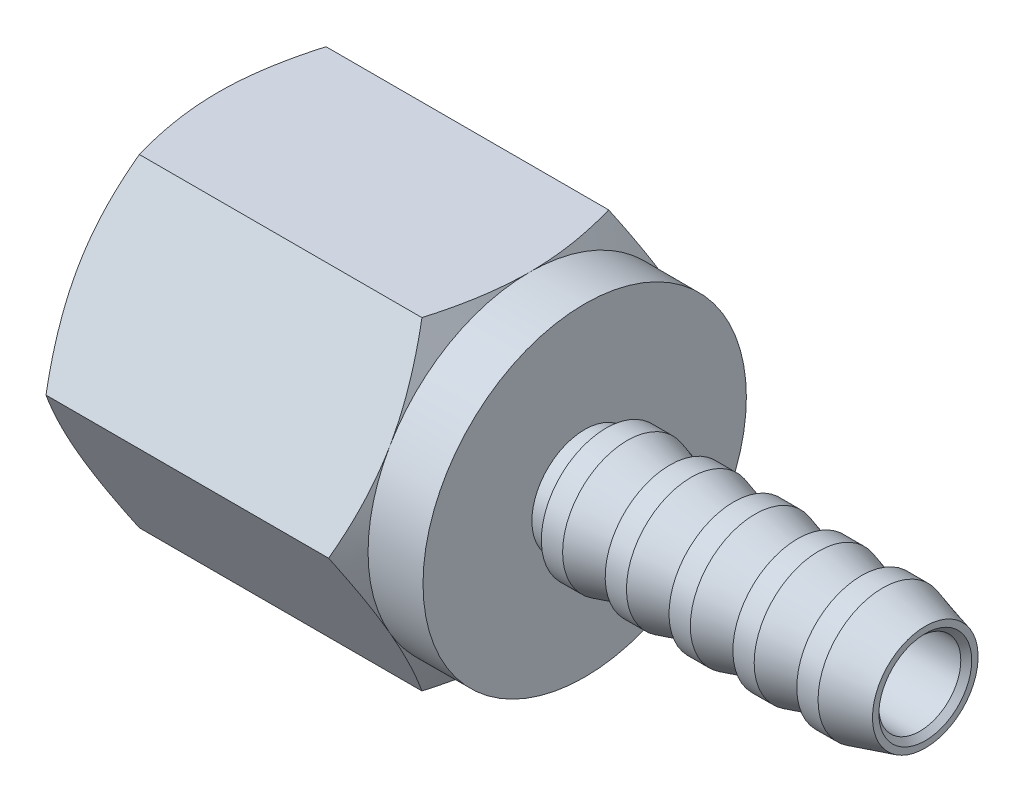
ISO-10303-21;
HEADER;
FILE_DESCRIPTION(('STEP AP214'),'2;1');
FILE_NAME('part.step','',(''),(''),'','','');
FILE_SCHEMA(('AUTOMOTIVE_DESIGN { 1 0 10303 214 1 1 1 1 }'));
ENDSEC;
DATA;
#1=APPLICATION_CONTEXT('core data for automotive mechanical design processes');
#2=APPLICATION_PROTOCOL_DEFINITION('international standard','automotive_design',2000,#1);
#3=PRODUCT_CONTEXT('',#1,'mechanical');
#4=PRODUCT('Part','Part','',(#3));
#5=PRODUCT_RELATED_PRODUCT_CATEGORY('part','',(#4));
#6=PRODUCT_DEFINITION_FORMATION('','',#4);
#7=PRODUCT_DEFINITION_CONTEXT('part definition',#1,'design');
#8=PRODUCT_DEFINITION('design','',#6,#7);
#9=PRODUCT_DEFINITION_SHAPE('','',#8);
#10=(LENGTH_UNIT() NAMED_UNIT(*) SI_UNIT(.MILLI.,.METRE.));
#11=(NAMED_UNIT(*) PLANE_ANGLE_UNIT() SI_UNIT($,.RADIAN.));
#12=(NAMED_UNIT(*) SI_UNIT($,.STERADIAN.) SOLID_ANGLE_UNIT());
#13=UNCERTAINTY_MEASURE_WITH_UNIT(LENGTH_MEASURE(1.E-05),#10,'distance_accuracy_value','');
#14=(GEOMETRIC_REPRESENTATION_CONTEXT(3) GLOBAL_UNCERTAINTY_ASSIGNED_CONTEXT((#13)) GLOBAL_UNIT_ASSIGNED_CONTEXT((#10,
#11,#12)) REPRESENTATION_CONTEXT('',''));
#15=CARTESIAN_POINT('',(0.,0.,0.));
#16=DIRECTION('',(0.,0.,1.));
#17=DIRECTION('',(1.,0.,0.));
#18=AXIS2_PLACEMENT_3D('',#15,#16,#17);
#19=CARTESIAN_POINT('',(37.893625,0.,3.46075000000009));
#20=DIRECTION('',(-1.,0.,0.));
#21=DIRECTION('',(0.,-1.,0.));
#22=AXIS2_PLACEMENT_3D('',#19,#20,#21);
#23=PLANE('',#22);
#24=CARTESIAN_POINT('',(37.8936249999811,0.,0.));
#25=DIRECTION('',(-1.,0.,0.));
#26=DIRECTION('',(0.,0.,1.));
#27=AXIS2_PLACEMENT_3D('',#24,#25,#26);
#28=CIRCLE('',#27,3.11149999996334);
#29=CARTESIAN_POINT('',(37.8936249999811,0.,3.11149999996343));
#30=VERTEX_POINT('',#29);
#31=EDGE_CURVE('E379',#30,#30,#28,.T.);
#32=ORIENTED_EDGE('',*,*,#31,.F.);
#33=EDGE_LOOP('',(#32));
#34=FACE_BOUND('',#33,.T.);
#35=CARTESIAN_POINT('',(37.893625,0.,0.));
#36=DIRECTION('',(1.,0.,0.));
#37=DIRECTION('',(0.,1.,0.));
#38=AXIS2_PLACEMENT_3D('',#35,#36,#37);
#39=CIRCLE('',#38,3.81000000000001);
#40=CARTESIAN_POINT('',(37.893625,3.80999999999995,0.));
#41=VERTEX_POINT('',#40);
#42=EDGE_CURVE('E19',#41,#41,#39,.T.);
#43=ORIENTED_EDGE('',*,*,#42,.F.);
#44=EDGE_LOOP('',(#43));
#45=FACE_BOUND('',#44,.T.);
#46=ADVANCED_FACE('F16',(#34,#45),#23,.T.);
#47=CARTESIAN_POINT('',(38.5206875,0.,0.));
#48=DIRECTION('',(1.,0.,0.));
#49=DIRECTION('',(0.,1.,0.));
#50=AXIS2_PLACEMENT_3D('',#47,#48,#49);
#51=CYLINDRICAL_SURFACE('',#50,3.81000000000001);
#52=CARTESIAN_POINT('',(39.1477499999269,0.,0.));
#53=DIRECTION('',(-1.,0.,0.));
#54=DIRECTION('',(0.,0.,1.));
#55=AXIS2_PLACEMENT_3D('',#52,#53,#54);
#56=CIRCLE('',#55,3.80999999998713);
#57=CARTESIAN_POINT('',(39.1477499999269,0.,3.80999999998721));
#58=VERTEX_POINT('',#57);
#59=EDGE_CURVE('E377',#58,#58,#56,.F.);
#60=ORIENTED_EDGE('',*,*,#59,.F.);
#61=EDGE_LOOP('',(#60));
#62=FACE_BOUND('',#61,.T.);
#63=ORIENTED_EDGE('',*,*,#42,.T.);
#64=EDGE_LOOP('',(#63));
#65=FACE_BOUND('',#64,.T.);
#66=ADVANCED_FACE('F486',(#62,#65),#51,.T.);
#67=CARTESIAN_POINT('',(35.3853750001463,0.,0.));
#68=DIRECTION('',(-1.,0.,0.));
#69=DIRECTION('',(0.,0.,1.));
#70=AXIS2_PLACEMENT_3D('',#67,#68,#69);
#71=CONICAL_SURFACE('',#70,3.80999999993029,0.271599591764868);
#72=ORIENTED_EDGE('',*,*,#31,.T.);
#73=EDGE_LOOP('',(#72));
#74=FACE_BOUND('',#73,.T.);
#75=CARTESIAN_POINT('',(35.385375,0.,0.));
#76=DIRECTION('',(1.,0.,0.));
#77=DIRECTION('',(0.,1.,0.));
#78=AXIS2_PLACEMENT_3D('',#75,#76,#77);
#79=CIRCLE('',#78,3.81000000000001);
#80=CARTESIAN_POINT('',(35.385375,3.80999999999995,0.));
#81=VERTEX_POINT('',#80);
#82=EDGE_CURVE('E373',#81,#81,#79,.F.);
#83=ORIENTED_EDGE('',*,*,#82,.F.);
#84=EDGE_LOOP('',(#83));
#85=FACE_BOUND('',#84,.T.);
#86=ADVANCED_FACE('F494',(#74,#85),#71,.T.);
#87=CARTESIAN_POINT('',(39.1477500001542,0.,0.));
#88=DIRECTION('',(-1.,0.,0.));
#89=DIRECTION('',(0.,0.,1.));
#90=AXIS2_PLACEMENT_3D('',#87,#88,#89);
#91=CONICAL_SURFACE('',#90,3.80999999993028,0.271599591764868);
#92=CARTESIAN_POINT('',(41.655999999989,0.,0.));
#93=DIRECTION('',(-1.,0.,0.));
#94=DIRECTION('',(0.,0.,1.));
#95=AXIS2_PLACEMENT_3D('',#92,#93,#94);
#96=CIRCLE('',#95,3.11149999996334);
#97=CARTESIAN_POINT('',(41.655999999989,0.,3.11149999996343));
#98=VERTEX_POINT('',#97);
#99=EDGE_CURVE('E376',#98,#98,#96,.F.);
#100=ORIENTED_EDGE('',*,*,#99,.F.);
#101=EDGE_LOOP('',(#100));
#102=FACE_BOUND('',#101,.T.);
#103=ORIENTED_EDGE('',*,*,#59,.T.);
#104=EDGE_LOOP('',(#103));
#105=FACE_BOUND('',#104,.T.);
#106=ADVANCED_FACE('F597',(#102,#105),#91,.T.);
#107=CARTESIAN_POINT('',(34.7583125,0.,0.));
#108=DIRECTION('',(1.,0.,0.));
#109=DIRECTION('',(0.,1.,0.));
#110=AXIS2_PLACEMENT_3D('',#107,#108,#109);
#111=CYLINDRICAL_SURFACE('',#110,3.81000000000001);
#112=ORIENTED_EDGE('',*,*,#82,.T.);
#113=EDGE_LOOP('',(#112));
#114=FACE_BOUND('',#113,.T.);
#115=CARTESIAN_POINT('',(34.13125,0.,0.));
#116=DIRECTION('',(1.,0.,0.));
#117=DIRECTION('',(0.,1.,0.));
#118=AXIS2_PLACEMENT_3D('',#115,#116,#117);
#119=CIRCLE('',#118,3.81000000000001);
#120=CARTESIAN_POINT('',(34.13125,3.80999999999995,0.));
#121=VERTEX_POINT('',#120);
#122=EDGE_CURVE('E476',#121,#121,#119,.F.);
#123=ORIENTED_EDGE('',*,*,#122,.F.);
#124=EDGE_LOOP('',(#123));
#125=FACE_BOUND('',#124,.T.);
#126=ADVANCED_FACE('F593',(#114,#125),#111,.T.);
#127=CARTESIAN_POINT('',(41.656,0.,2.92311666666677));
#128=DIRECTION('',(1.,0.,0.));
#129=DIRECTION('',(0.,1.,0.));
#130=AXIS2_PLACEMENT_3D('',#127,#128,#129);
#131=PLANE('',#130);
#132=ORIENTED_EDGE('',*,*,#99,.T.);
#133=EDGE_LOOP('',(#132));
#134=FACE_BOUND('',#133,.T.);
#135=CARTESIAN_POINT('',(41.655999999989,0.,0.));
#136=DIRECTION('',(1.,0.,0.));
#137=DIRECTION('',(0.,0.,-1.));
#138=AXIS2_PLACEMENT_3D('',#135,#136,#137);
#139=CIRCLE('',#138,2.73473333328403);
#140=CARTESIAN_POINT('',(41.655999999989,0.,-2.73473333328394));
#141=VERTEX_POINT('',#140);
#142=EDGE_CURVE('E473',#141,#141,#139,.T.);
#143=ORIENTED_EDGE('',*,*,#142,.F.);
#144=EDGE_LOOP('',(#143));
#145=FACE_BOUND('',#144,.T.);
#146=ADVANCED_FACE('F589',(#134,#145),#131,.T.);
#147=CARTESIAN_POINT('',(34.13125,0.,3.46075000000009));
#148=DIRECTION('',(-1.,0.,0.));
#149=DIRECTION('',(0.,-1.,0.));
#150=AXIS2_PLACEMENT_3D('',#147,#148,#149);
#151=PLANE('',#150);
#152=CARTESIAN_POINT('',(34.1312499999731,0.,0.));
#153=DIRECTION('',(-1.,0.,0.));
#154=DIRECTION('',(0.,0.,1.));
#155=AXIS2_PLACEMENT_3D('',#152,#153,#154);
#156=CIRCLE('',#155,3.11150000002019);
#157=CARTESIAN_POINT('',(34.1312499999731,0.,3.11150000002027));
#158=VERTEX_POINT('',#157);
#159=EDGE_CURVE('E372',#158,#158,#156,.T.);
#160=ORIENTED_EDGE('',*,*,#159,.F.);
#161=EDGE_LOOP('',(#160));
#162=FACE_BOUND('',#161,.T.);
#163=ORIENTED_EDGE('',*,*,#122,.T.);
#164=EDGE_LOOP('',(#163));
#165=FACE_BOUND('',#164,.T.);
#166=ADVANCED_FACE('F585',(#162,#165),#151,.T.);
#167=CARTESIAN_POINT('',(41.3342666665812,0.,0.));
#168=DIRECTION('',(1.,0.,0.));
#169=DIRECTION('',(0.,0.,-1.));
#170=AXIS2_PLACEMENT_3D('',#167,#168,#169);
#171=CONICAL_SURFACE('',#170,2.41299999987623,0.785398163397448);
#172=ORIENTED_EDGE('',*,*,#142,.T.);
#173=EDGE_LOOP('',(#172));
#174=FACE_BOUND('',#173,.T.);
#175=CARTESIAN_POINT('',(41.3342666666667,0.,0.));
#176=DIRECTION('',(-1.,0.,0.));
#177=DIRECTION('',(0.,0.,1.));
#178=AXIS2_PLACEMENT_3D('',#175,#176,#177);
#179=CIRCLE('',#178,2.41300000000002);
#180=CARTESIAN_POINT('',(41.3342666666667,0.,2.4130000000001));
#181=VERTEX_POINT('',#180);
#182=EDGE_CURVE('E369',#181,#181,#179,.F.);
#183=ORIENTED_EDGE('',*,*,#182,.F.);
#184=EDGE_LOOP('',(#183));
#185=FACE_BOUND('',#184,.T.);
#186=ADVANCED_FACE('F581',(#174,#185),#171,.F.);
#187=CARTESIAN_POINT('',(31.6229999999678,0.,0.));
#188=DIRECTION('',(-1.,0.,0.));
#189=DIRECTION('',(0.,0.,1.));
#190=AXIS2_PLACEMENT_3D('',#187,#188,#189);
#191=CONICAL_SURFACE('',#190,3.81000000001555,0.271599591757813);
#192=ORIENTED_EDGE('',*,*,#159,.T.);
#193=EDGE_LOOP('',(#192));
#194=FACE_BOUND('',#193,.T.);
#195=CARTESIAN_POINT('',(31.623,0.,0.));
#196=DIRECTION('',(1.,0.,0.));
#197=DIRECTION('',(0.,1.,0.));
#198=AXIS2_PLACEMENT_3D('',#195,#196,#197);
#199=CIRCLE('',#198,3.81000000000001);
#200=CARTESIAN_POINT('',(31.623,3.80999999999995,0.));
#201=VERTEX_POINT('',#200);
#202=EDGE_CURVE('E366',#201,#201,#199,.F.);
#203=ORIENTED_EDGE('',*,*,#202,.F.);
#204=EDGE_LOOP('',(#203));
#205=FACE_BOUND('',#204,.T.);
#206=ADVANCED_FACE('F577',(#194,#205),#191,.T.);
#207=CARTESIAN_POINT('',(18.3515,0.,0.));
#208=DIRECTION('',(1.,0.,0.));
#209=DIRECTION('',(0.,1.,0.));
#210=AXIS2_PLACEMENT_3D('',#207,#208,#209);
#211=CYLINDRICAL_SURFACE('',#210,2.41300000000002);
#212=ORIENTED_EDGE('',*,*,#182,.T.);
#213=EDGE_LOOP('',(#212));
#214=FACE_BOUND('',#213,.T.);
#215=CARTESIAN_POINT('',(18.3515000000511,0.,0.));
#216=DIRECTION('',(-1.,0.,0.));
#217=DIRECTION('',(0.,0.,1.));
#218=AXIS2_PLACEMENT_3D('',#215,#216,#217);
#219=CIRCLE('',#218,2.41299999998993);
#220=CARTESIAN_POINT('',(18.3515000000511,0.,2.41299999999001));
#221=VERTEX_POINT('',#220);
#222=EDGE_CURVE('E363',#221,#221,#219,.F.);
#223=ORIENTED_EDGE('',*,*,#222,.F.);
#224=EDGE_LOOP('',(#223));
#225=FACE_BOUND('',#224,.T.);
#226=ADVANCED_FACE('F573',(#214,#225),#211,.F.);
#227=CARTESIAN_POINT('',(30.9959375,0.,0.));
#228=DIRECTION('',(1.,0.,0.));
#229=DIRECTION('',(0.,1.,0.));
#230=AXIS2_PLACEMENT_3D('',#227,#228,#229);
#231=CYLINDRICAL_SURFACE('',#230,3.81000000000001);
#232=ORIENTED_EDGE('',*,*,#202,.T.);
#233=EDGE_LOOP('',(#232));
#234=FACE_BOUND('',#233,.T.);
#235=CARTESIAN_POINT('',(30.368875,0.,0.));
#236=DIRECTION('',(1.,0.,0.));
#237=DIRECTION('',(0.,1.,0.));
#238=AXIS2_PLACEMENT_3D('',#235,#236,#237);
#239=CIRCLE('',#238,3.81000000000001);
#240=CARTESIAN_POINT('',(30.368875,3.80999999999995,0.));
#241=VERTEX_POINT('',#240);
#242=EDGE_CURVE('E362',#241,#241,#239,.F.);
#243=ORIENTED_EDGE('',*,*,#242,.F.);
#244=EDGE_LOOP('',(#243));
#245=FACE_BOUND('',#244,.T.);
#246=ADVANCED_FACE('F569',(#234,#245),#231,.T.);
#247=CARTESIAN_POINT('',(18.351500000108,0.,0.));
#248=DIRECTION('',(-1.,0.,0.));
#249=DIRECTION('',(0.,0.,1.));
#250=AXIS2_PLACEMENT_3D('',#247,#248,#249);
#251=CONICAL_SURFACE('',#250,2.41299999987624,1.0471975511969);
#252=ORIENTED_EDGE('',*,*,#222,.T.);
#253=EDGE_LOOP('',(#252));
#254=FACE_BOUND('',#253,.T.);
#255=CARTESIAN_POINT('',(16.2213468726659,0.,0.));
#256=DIRECTION('',(-1.,0.,0.));
#257=DIRECTION('',(0.,0.,1.));
#258=AXIS2_PLACEMENT_3D('',#255,#256,#257);
#259=CIRCLE('',#258,6.10253344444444);
#260=CARTESIAN_POINT('',(16.2213468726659,0.,6.10253344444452));
#261=VERTEX_POINT('',#260);
#262=EDGE_CURVE('E359',#261,#261,#259,.F.);
#263=ORIENTED_EDGE('',*,*,#262,.F.);
#264=EDGE_LOOP('',(#263));
#265=FACE_BOUND('',#264,.T.);
#266=ADVANCED_FACE('F565',(#254,#265),#251,.F.);
#267=CARTESIAN_POINT('',(30.368875,0.,3.46075000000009));
#268=DIRECTION('',(-1.,0.,0.));
#269=DIRECTION('',(0.,-1.,0.));
#270=AXIS2_PLACEMENT_3D('',#267,#268,#269);
#271=PLANE('',#270);
#272=CARTESIAN_POINT('',(30.3688750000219,0.,0.));
#273=DIRECTION('',(-1.,0.,0.));
#274=DIRECTION('',(0.,-1.,0.));
#275=AXIS2_PLACEMENT_3D('',#272,#273,#274);
#276=CIRCLE('',#275,3.11149999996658);
#277=CARTESIAN_POINT('',(30.3688750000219,-3.11149999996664,0.));
#278=VERTEX_POINT('',#277);
#279=EDGE_CURVE('E358',#278,#278,#276,.T.);
#280=ORIENTED_EDGE('',*,*,#279,.F.);
#281=EDGE_LOOP('',(#280));
#282=FACE_BOUND('',#281,.T.);
#283=ORIENTED_EDGE('',*,*,#242,.T.);
#284=EDGE_LOOP('',(#283));
#285=FACE_BOUND('',#284,.T.);
#286=ADVANCED_FACE('F561',(#282,#285),#271,.T.);
#287=CARTESIAN_POINT('',(12.8016,0.,0.));
#288=DIRECTION('',(1.,0.,0.));
#289=DIRECTION('',(0.,1.,0.));
#290=AXIS2_PLACEMENT_3D('',#287,#288,#289);
#291=CYLINDRICAL_SURFACE('',#290,6.10253344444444);
#292=ORIENTED_EDGE('',*,*,#262,.T.);
#293=EDGE_LOOP('',(#292));
#294=FACE_BOUND('',#293,.T.);
#295=CARTESIAN_POINT('',(12.8015999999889,0.,0.));
#296=DIRECTION('',(-1.,0.,0.));
#297=DIRECTION('',(0.,0.,1.));
#298=AXIS2_PLACEMENT_3D('',#295,#296,#297);
#299=CIRCLE('',#298,6.10253344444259);
#300=CARTESIAN_POINT('',(12.8015999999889,0.,6.10253344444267));
#301=VERTEX_POINT('',#300);
#302=EDGE_CURVE('E355',#301,#301,#299,.F.);
#303=ORIENTED_EDGE('',*,*,#302,.F.);
#304=EDGE_LOOP('',(#303));
#305=FACE_BOUND('',#304,.T.);
#306=ADVANCED_FACE('F557',(#294,#305),#291,.F.);
#307=CARTESIAN_POINT('',(27.860625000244,0.,0.));
#308=DIRECTION('',(-1.,0.,0.));
#309=DIRECTION('',(0.,-1.,0.));
#310=AXIS2_PLACEMENT_3D('',#307,#308,#309);
#311=CONICAL_SURFACE('',#310,3.80999999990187,0.271599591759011);
#312=ORIENTED_EDGE('',*,*,#279,.T.);
#313=EDGE_LOOP('',(#312));
#314=FACE_BOUND('',#313,.T.);
#315=CARTESIAN_POINT('',(27.860625,0.,0.));
#316=DIRECTION('',(1.,0.,0.));
#317=DIRECTION('',(0.,1.,0.));
#318=AXIS2_PLACEMENT_3D('',#315,#316,#317);
#319=CIRCLE('',#318,3.81000000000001);
#320=CARTESIAN_POINT('',(27.860625,3.80999999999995,0.));
#321=VERTEX_POINT('',#320);
#322=EDGE_CURVE('E352',#321,#321,#319,.F.);
#323=ORIENTED_EDGE('',*,*,#322,.F.);
#324=EDGE_LOOP('',(#323));
#325=FACE_BOUND('',#324,.T.);
#326=ADVANCED_FACE('F553',(#314,#325),#311,.T.);
#327=CARTESIAN_POINT('',(12.8016000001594,0.,0.));
#328=DIRECTION('',(-1.,0.,0.));
#329=DIRECTION('',(0.,0.,1.));
#330=AXIS2_PLACEMENT_3D('',#327,#328,#329);
#331=CONICAL_SURFACE('',#330,6.10253344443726,0.0310668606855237);
#332=ORIENTED_EDGE('',*,*,#302,.T.);
#333=EDGE_LOOP('',(#332));
#334=FACE_BOUND('',#333,.T.);
#335=CARTESIAN_POINT('',(0.180909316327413,0.,0.));
#336=DIRECTION('',(-1.,0.,0.));
#337=DIRECTION('',(0.,1.,0.));
#338=AXIS2_PLACEMENT_3D('',#335,#336,#337);
#339=CIRCLE('',#338,6.49474487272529);
#340=CARTESIAN_POINT('',(0.180909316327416,6.49474487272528,0.));
#341=VERTEX_POINT('',#340);
#342=EDGE_CURVE('E348',#341,#341,#339,.T.);
#343=ORIENTED_EDGE('',*,*,#342,.T.);
#344=EDGE_LOOP('',(#343));
#345=FACE_BOUND('',#344,.T.);
#346=ADVANCED_FACE('F549',(#334,#345),#331,.F.);
#347=CARTESIAN_POINT('',(27.2335625,0.,0.));
#348=DIRECTION('',(1.,0.,0.));
#349=DIRECTION('',(0.,1.,0.));
#350=AXIS2_PLACEMENT_3D('',#347,#348,#349);
#351=CYLINDRICAL_SURFACE('',#350,3.81000000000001);
#352=ORIENTED_EDGE('',*,*,#322,.T.);
#353=EDGE_LOOP('',(#352));
#354=FACE_BOUND('',#353,.T.);
#355=CARTESIAN_POINT('',(26.6065,0.,0.));
#356=DIRECTION('',(1.,0.,0.));
#357=DIRECTION('',(0.,1.,0.));
#358=AXIS2_PLACEMENT_3D('',#355,#356,#357);
#359=CIRCLE('',#358,3.81000000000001);
#360=CARTESIAN_POINT('',(26.6065,3.80999999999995,0.));
#361=VERTEX_POINT('',#360);
#362=EDGE_CURVE('E351',#361,#361,#359,.F.);
#363=ORIENTED_EDGE('',*,*,#362,.F.);
#364=EDGE_LOOP('',(#363));
#365=FACE_BOUND('',#364,.T.);
#366=ADVANCED_FACE('F545',(#354,#365),#351,.T.);
#367=CARTESIAN_POINT('',(1.13684753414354E-10,0.,0.));
#368=DIRECTION('',(-1.,0.,0.));
#369=DIRECTION('',(0.,-1.,0.));
#370=AXIS2_PLACEMENT_3D('',#367,#368,#369);
#371=CONICAL_SURFACE('',#370,6.80808900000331,1.0471975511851);
#372=CARTESIAN_POINT('',(1.13693767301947E-10,0.,0.));
#373=DIRECTION('',(-1.,0.,0.));
#374=DIRECTION('',(0.,-1.,0.));
#375=AXIS2_PLACEMENT_3D('',#372,#373,#374);
#376=CIRCLE('',#375,6.80808900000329);
#377=CARTESIAN_POINT('',(1.13691682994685E-10,-6.80808900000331,0.));
#378=VERTEX_POINT('',#377);
#379=EDGE_CURVE('E462',#378,#378,#376,.F.);
#380=ORIENTED_EDGE('',*,*,#379,.F.);
#381=EDGE_LOOP('',(#380));
#382=FACE_BOUND('',#381,.T.);
#383=ORIENTED_EDGE('',*,*,#342,.F.);
#384=EDGE_LOOP('',(#383));
#385=FACE_BOUND('',#384,.T.);
#386=ADVANCED_FACE('F541',(#382,#385),#371,.F.);
#387=CARTESIAN_POINT('',(26.6065,0.,3.46075000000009));
#388=DIRECTION('',(-1.,0.,0.));
#389=DIRECTION('',(0.,-1.,0.));
#390=AXIS2_PLACEMENT_3D('',#387,#388,#389);
#391=PLANE('',#390);
#392=CARTESIAN_POINT('',(26.606500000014,0.,0.));
#393=DIRECTION('',(-1.,0.,0.));
#394=DIRECTION('',(0.,0.,1.));
#395=AXIS2_PLACEMENT_3D('',#392,#393,#394);
#396=CIRCLE('',#395,3.11149999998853);
#397=CARTESIAN_POINT('',(26.606500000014,0.,3.11149999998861));
#398=VERTEX_POINT('',#397);
#399=EDGE_CURVE('E123',#398,#398,#396,.T.);
#400=ORIENTED_EDGE('',*,*,#399,.F.);
#401=EDGE_LOOP('',(#400));
#402=FACE_BOUND('',#401,.T.);
#403=ORIENTED_EDGE('',*,*,#362,.T.);
#404=EDGE_LOOP('',(#403));
#405=FACE_BOUND('',#404,.T.);
#406=ADVANCED_FACE('F535',(#402,#405),#391,.T.);
#407=CARTESIAN_POINT('',(0.,0.,8.0126834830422));
#408=DIRECTION('',(-1.,0.,0.));
#409=DIRECTION('',(0.,-1.,0.));
#410=AXIS2_PLACEMENT_3D('',#407,#408,#409);
#411=PLANE('',#410);
#412=ORIENTED_EDGE('',*,*,#379,.T.);
#413=EDGE_LOOP('',(#412));
#414=FACE_BOUND('',#413,.T.);
#415=CARTESIAN_POINT('',(-4.03567427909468E-13,0.,0.));
#416=DIRECTION('',(1.,0.,0.));
#417=DIRECTION('',(0.,0.,-1.));
#418=AXIS2_PLACEMENT_3D('',#415,#416,#417);
#419=CIRCLE('',#418,9.525);
#420=CARTESIAN_POINT('',(-3.95355726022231E-13,-4.76250000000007,-8.24889197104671));
#421=VERTEX_POINT('',#420);
#422=CARTESIAN_POINT('',(-4.13494323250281E-13,-9.52500000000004,0.));
#423=VERTEX_POINT('',#422);
#424=EDGE_CURVE('E105',#421,#423,#419,.F.);
#425=ORIENTED_EDGE('',*,*,#424,.T.);
#426=CARTESIAN_POINT('',(-4.1458440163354E-13,0.,0.));
#427=DIRECTION('',(1.,0.,0.));
#428=DIRECTION('',(0.,0.,-1.));
#429=AXIS2_PLACEMENT_3D('',#426,#427,#428);
#430=CIRCLE('',#429,9.52499999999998);
#431=CARTESIAN_POINT('',(-4.16982886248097E-13,-4.76250000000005,8.24889197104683));
#432=VERTEX_POINT('',#431);
#433=EDGE_CURVE('E347',#423,#432,#430,.F.);
#434=ORIENTED_EDGE('',*,*,#433,.T.);
#435=CARTESIAN_POINT('',(-4.11414454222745E-13,0.,0.));
#436=DIRECTION('',(1.,0.,0.));
#437=DIRECTION('',(0.,0.,-1.));
#438=AXIS2_PLACEMENT_3D('',#435,#436,#437);
#439=CIRCLE('',#438,9.52499999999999);
#440=CARTESIAN_POINT('',(-4.10013914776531E-13,4.76249999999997,8.24889197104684));
#441=VERTEX_POINT('',#440);
#442=EDGE_CURVE('E451',#432,#441,#439,.F.);
#443=ORIENTED_EDGE('',*,*,#442,.T.);
#444=CARTESIAN_POINT('',(-4.06478646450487E-13,0.,0.));
#445=DIRECTION('',(1.,0.,0.));
#446=DIRECTION('',(0.,0.,-1.));
#447=AXIS2_PLACEMENT_3D('',#444,#445,#446);
#448=CIRCLE('',#447,9.525);
#449=CARTESIAN_POINT('',(-4.03562552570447E-13,9.52499999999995,0.));
#450=VERTEX_POINT('',#449);
#451=EDGE_CURVE('E417',#441,#450,#448,.F.);
#452=ORIENTED_EDGE('',*,*,#451,.T.);
#453=CARTESIAN_POINT('',(-4.06478646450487E-13,0.,0.));
#454=DIRECTION('',(1.,0.,0.));
#455=DIRECTION('',(0.,0.,-1.));
#456=AXIS2_PLACEMENT_3D('',#453,#454,#455);
#457=CIRCLE('',#456,9.525);
#458=CARTESIAN_POINT('',(-3.94400184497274E-13,4.76249999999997,-8.24889197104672));
#459=VERTEX_POINT('',#458);
#460=EDGE_CURVE('E108',#450,#459,#457,.F.);
#461=ORIENTED_EDGE('',*,*,#460,.T.);
#462=CARTESIAN_POINT('',(-3.90288639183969E-13,0.,0.));
#463=DIRECTION('',(1.,0.,0.));
#464=DIRECTION('',(0.,0.,-1.));
#465=AXIS2_PLACEMENT_3D('',#462,#463,#464);
#466=CIRCLE('',#465,9.52500000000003);
#467=EDGE_CURVE('E102',#459,#421,#466,.F.);
#468=ORIENTED_EDGE('',*,*,#467,.T.);
#469=EDGE_LOOP('',(#425,#434,#443,#452,#461,#468));
#470=FACE_BOUND('',#469,.T.);
#471=ADVANCED_FACE('F104',(#414,#470),#411,.T.);
#472=CARTESIAN_POINT('',(24.0982500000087,0.,0.));
#473=DIRECTION('',(-1.,0.,0.));
#474=DIRECTION('',(0.,0.,1.));
#475=AXIS2_PLACEMENT_3D('',#472,#473,#474);
#476=CONICAL_SURFACE('',#475,3.80999999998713,0.271599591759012);
#477=ORIENTED_EDGE('',*,*,#399,.T.);
#478=EDGE_LOOP('',(#477));
#479=FACE_BOUND('',#478,.T.);
#480=CARTESIAN_POINT('',(24.09825,0.,0.));
#481=DIRECTION('',(1.,0.,0.));
#482=DIRECTION('',(0.,1.,0.));
#483=AXIS2_PLACEMENT_3D('',#480,#481,#482);
#484=CIRCLE('',#483,3.81000000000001);
#485=CARTESIAN_POINT('',(24.09825,3.80999999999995,0.));
#486=VERTEX_POINT('',#485);
#487=EDGE_CURVE('E343',#486,#486,#484,.F.);
#488=ORIENTED_EDGE('',*,*,#487,.F.);
#489=EDGE_LOOP('',(#488));
#490=FACE_BOUND('',#489,.T.);
#491=ADVANCED_FACE('F528',(#479,#490),#476,.T.);
#492=CARTESIAN_POINT('',(-4.15585944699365E-13,0.,0.));
#493=DIRECTION('',(1.,0.,0.));
#494=DIRECTION('',(0.,0.,-1.));
#495=AXIS2_PLACEMENT_3D('',#492,#493,#494);
#496=CONICAL_SURFACE('',#495,9.52499999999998,1.0471975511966);
#497=ORIENTED_EDGE('',*,*,#424,.F.);
#498=CARTESIAN_POINT('',(0.850738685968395,-9.52500000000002,-5.49926131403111));
#499=CARTESIAN_POINT('',(0.721484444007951,-9.13733452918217,-5.72308007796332));
#500=CARTESIAN_POINT('',(0.603064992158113,-8.74656449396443,-5.94869126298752));
#501=CARTESIAN_POINT('',(0.394234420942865,-7.96157982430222,-6.40190237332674));
#502=CARTESIAN_POINT('',(0.30368480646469,-7.5673925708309,-6.62948649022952));
#503=CARTESIAN_POINT('',(0.192505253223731,-6.97239151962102,-6.97301050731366));
#504=CARTESIAN_POINT('',(0.159539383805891,-6.77330622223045,-7.0879524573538));
#505=CARTESIAN_POINT('',(0.102474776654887,-6.37418252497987,-7.31838663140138));
#506=CARTESIAN_POINT('',(0.0783758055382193,-6.17414415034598,-7.43387884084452));
#507=CARTESIAN_POINT('',(0.0394684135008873,-5.77237438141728,-7.66584072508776));
#508=CARTESIAN_POINT('',(0.0247072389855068,-5.57063952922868,-7.78231239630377));
#509=CARTESIAN_POINT('',(0.00495260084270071,-5.16677307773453,-8.01548480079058));
#510=CARTESIAN_POINT('',(-3.89283204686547E-05,-4.96464140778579,-8.13218557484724));
#511=CARTESIAN_POINT('',(-4.01248193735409E-13,-4.76250000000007,-8.24889197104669));
#512=B_SPLINE_CURVE_WITH_KNOTS('',3,(#498,#499,#500,#501,#502,#503,#504,#505,#506,#507,#508,
#509,#510,#511),.UNSPECIFIED.,.F.,.F.,(4,2,2,2,2,2,4),(0.,1.39833983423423,2.78961424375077,
3.48616426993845,4.18269596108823,4.88272428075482,5.58289119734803),.UNSPECIFIED.);
#513=CARTESIAN_POINT('',(0.850738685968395,-9.52500000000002,-5.49926131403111));
#514=VERTEX_POINT('',#513);
#515=EDGE_CURVE('E119',#514,#421,#512,.T.);
#516=ORIENTED_EDGE('',*,*,#515,.F.);
#517=CARTESIAN_POINT('',(-4.20505124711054E-13,-9.52500000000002,0.));
#518=CARTESIAN_POINT('',(-3.89283204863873E-05,-9.52500000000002,-0.233412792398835));
#519=CARTESIAN_POINT('',(0.00495260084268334,-9.52500000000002,-0.466814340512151));
#520=CARTESIAN_POINT('',(0.0247072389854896,-9.52500000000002,-0.93315914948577));
#521=CARTESIAN_POINT('',(0.03946841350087,-9.52500000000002,-1.1661024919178));
#522=CARTESIAN_POINT('',(0.0783758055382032,-9.52500000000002,-1.63002626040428));
#523=CARTESIAN_POINT('',(0.102474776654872,-9.52500000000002,-1.86101067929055));
#524=CARTESIAN_POINT('',(0.159539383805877,-9.52500000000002,-2.32187902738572));
#525=CARTESIAN_POINT('',(0.192505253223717,-9.52500000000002,-2.55176292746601));
#526=CARTESIAN_POINT('',(0.303684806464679,-9.52500000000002,-3.23881096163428));
#527=CARTESIAN_POINT('',(0.394234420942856,-9.52500000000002,-3.69397919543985));
#528=CARTESIAN_POINT('',(0.603064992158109,-9.52500000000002,-4.60040141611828));
#529=CARTESIAN_POINT('',(0.72148444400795,-9.52500000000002,-5.05162378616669));
#530=CARTESIAN_POINT('',(0.850738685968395,-9.52500000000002,-5.49926131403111));
#531=B_SPLINE_CURVE_WITH_KNOTS('',3,(#517,#518,#519,#520,#521,#522,#523,#524,#525,#526,#527,
#528,#529,#530),.UNSPECIFIED.,.F.,.F.,(4,2,2,2,2,2,4),(0.,0.700166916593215,1.40019523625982,
2.0967269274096,2.79327695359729,4.18455136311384,5.58289119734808),.UNSPECIFIED.);
#532=EDGE_CURVE('E121',#423,#514,#531,.T.);
#533=ORIENTED_EDGE('',*,*,#532,.F.);
#534=EDGE_LOOP('',(#497,#516,#533));
#535=FACE_BOUND('',#534,.T.);
#536=ADVANCED_FACE('F117',(#535),#496,.T.);
#537=CARTESIAN_POINT('',(-4.04310242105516E-13,0.,0.));
#538=DIRECTION('',(1.,0.,0.));
#539=DIRECTION('',(0.,0.,-1.));
#540=AXIS2_PLACEMENT_3D('',#537,#538,#539);
#541=CONICAL_SURFACE('',#540,9.525,1.0471975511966);
#542=CARTESIAN_POINT('',(-4.02491720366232E-13,-4.76250000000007,-8.24889197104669));
#543=CARTESIAN_POINT('',(-3.8928320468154E-05,-4.56035859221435,-8.36559836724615));
#544=CARTESIAN_POINT('',(0.00495260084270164,-4.3582269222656,-8.48229914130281));
#545=CARTESIAN_POINT('',(0.0247072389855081,-3.95436047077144,-8.71547154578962));
#546=CARTESIAN_POINT('',(0.0394684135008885,-3.75262561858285,-8.83194321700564));
#547=CARTESIAN_POINT('',(0.0783758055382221,-3.35085584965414,-9.06390510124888));
#548=CARTESIAN_POINT('',(0.102474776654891,-3.15081747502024,-9.17939731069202));
#549=CARTESIAN_POINT('',(0.159539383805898,-2.75169377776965,-9.40983148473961));
#550=CARTESIAN_POINT('',(0.192505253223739,-2.55260848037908,-9.52477343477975));
#551=CARTESIAN_POINT('',(0.303684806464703,-1.95760742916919,-9.8682974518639));
#552=CARTESIAN_POINT('',(0.394234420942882,-1.56342017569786,-10.0958815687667));
#553=CARTESIAN_POINT('',(0.603064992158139,-0.778435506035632,-10.5490926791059));
#554=CARTESIAN_POINT('',(0.721484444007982,-0.387665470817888,-10.7747038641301));
#555=CARTESIAN_POINT('',(0.850738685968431,0.,-10.9985226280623));
#556=B_SPLINE_CURVE_WITH_KNOTS('',3,(#542,#543,#544,#545,#546,#547,#548,#549,#550,#551,#552,
#553,#554,#555),.UNSPECIFIED.,.F.,.F.,(4,2,2,2,2,2,4),(0.,0.700166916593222,1.40019523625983,
2.09672692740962,2.79327695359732,4.18455136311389,5.58289119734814),.UNSPECIFIED.);
#557=CARTESIAN_POINT('',(0.850738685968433,0.,-10.9985226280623));
#558=VERTEX_POINT('',#557);
#559=EDGE_CURVE('E125',#421,#558,#556,.T.);
#560=ORIENTED_EDGE('',*,*,#559,.F.);
#561=ORIENTED_EDGE('',*,*,#467,.F.);
#562=CARTESIAN_POINT('',(0.850738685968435,0.,-10.9985226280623));
#563=CARTESIAN_POINT('',(0.72148444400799,0.387665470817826,-10.7747038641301));
#564=CARTESIAN_POINT('',(0.603064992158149,0.778435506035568,-10.5490926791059));
#565=CARTESIAN_POINT('',(0.394234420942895,1.5634201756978,-10.0958815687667));
#566=CARTESIAN_POINT('',(0.303684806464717,1.95760742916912,-9.86829745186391));
#567=CARTESIAN_POINT('',(0.192505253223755,2.552608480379,-9.52477343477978));
#568=CARTESIAN_POINT('',(0.159539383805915,2.75169377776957,-9.40983148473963));
#569=CARTESIAN_POINT('',(0.10247477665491,3.15081747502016,-9.17939731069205));
#570=CARTESIAN_POINT('',(0.0783758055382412,3.35085584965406,-9.06390510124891));
#571=CARTESIAN_POINT('',(0.0394684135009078,3.75262561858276,-8.83194321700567));
#572=CARTESIAN_POINT('',(0.0247072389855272,3.95436047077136,-8.71547154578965));
#573=CARTESIAN_POINT('',(0.00495260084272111,4.35822692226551,-8.48229914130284));
#574=CARTESIAN_POINT('',(-3.89283204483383E-05,4.56035859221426,-8.36559836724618));
#575=CARTESIAN_POINT('',(-3.81798296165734E-13,4.76249999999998,-8.24889197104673));
#576=B_SPLINE_CURVE_WITH_KNOTS('',3,(#562,#563,#564,#565,#566,#567,#568,#569,#570,#571,#572,
#573,#574,#575),.UNSPECIFIED.,.F.,.F.,(4,2,2,2,2,2,4),(0.,1.39833983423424,2.7896142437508,
3.48616426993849,4.18269596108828,4.88272428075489,5.5828911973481),.UNSPECIFIED.);
#577=EDGE_CURVE('E128',#558,#459,#576,.T.);
#578=ORIENTED_EDGE('',*,*,#577,.F.);
#579=EDGE_LOOP('',(#560,#561,#578));
#580=FACE_BOUND('',#579,.T.);
#581=ADVANCED_FACE('F126',(#580),#541,.T.);
#582=CARTESIAN_POINT('',(-4.06478646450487E-13,0.,0.));
#583=DIRECTION('',(1.,0.,0.));
#584=DIRECTION('',(0.,0.,-1.));
#585=AXIS2_PLACEMENT_3D('',#582,#583,#584);
#586=CONICAL_SURFACE('',#585,9.525,1.0471975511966);
#587=CARTESIAN_POINT('',(-3.809620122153E-13,4.76249999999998,-8.24889197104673));
#588=CARTESIAN_POINT('',(-3.89283204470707E-05,4.9646414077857,-8.13218557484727));
#589=CARTESIAN_POINT('',(0.00495260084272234,5.16677307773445,-8.01548480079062));
#590=CARTESIAN_POINT('',(0.024707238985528,5.5706395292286,-7.78231239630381));
#591=CARTESIAN_POINT('',(0.0394684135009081,5.77237438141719,-7.66584072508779));
#592=CARTESIAN_POINT('',(0.0783758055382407,6.17414415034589,-7.43387884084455));
#593=CARTESIAN_POINT('',(0.102474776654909,6.37418252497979,-7.31838663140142));
#594=CARTESIAN_POINT('',(0.159539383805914,6.77330622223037,-7.08795245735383));
#595=CARTESIAN_POINT('',(0.192505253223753,6.97239151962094,-6.97301050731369));
#596=CARTESIAN_POINT('',(0.303684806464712,7.56739257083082,-6.62948649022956));
#597=CARTESIAN_POINT('',(0.394234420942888,7.96157982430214,-6.40190237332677));
#598=CARTESIAN_POINT('',(0.603064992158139,8.74656449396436,-5.94869126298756));
#599=CARTESIAN_POINT('',(0.721484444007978,9.1373345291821,-5.72308007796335));
#600=CARTESIAN_POINT('',(0.850738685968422,9.52499999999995,-5.49926131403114));
#601=B_SPLINE_CURVE_WITH_KNOTS('',3,(#587,#588,#589,#590,#591,#592,#593,#594,#595,#596,#597,
#598,#599,#600),.UNSPECIFIED.,.F.,.F.,(4,2,2,2,2,2,4),(0.,0.700166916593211,1.40019523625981,
2.09672692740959,2.79327695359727,4.18455136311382,5.58289119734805),.UNSPECIFIED.);
#602=CARTESIAN_POINT('',(0.850738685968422,9.52499999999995,-5.49926131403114));
#603=VERTEX_POINT('',#602);
#604=EDGE_CURVE('E328',#459,#603,#601,.T.);
#605=ORIENTED_EDGE('',*,*,#604,.F.);
#606=ORIENTED_EDGE('',*,*,#460,.F.);
#607=CARTESIAN_POINT('',(0.850738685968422,9.52499999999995,-5.49926131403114));
#608=CARTESIAN_POINT('',(0.721484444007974,9.52499999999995,-5.05162378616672));
#609=CARTESIAN_POINT('',(0.603064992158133,9.52499999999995,-4.60040141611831));
#610=CARTESIAN_POINT('',(0.394234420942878,9.52499999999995,-3.69397919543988));
#611=CARTESIAN_POINT('',(0.3036848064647,9.52499999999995,-3.2388109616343));
#612=CARTESIAN_POINT('',(0.192505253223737,9.52499999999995,-2.55176292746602));
#613=CARTESIAN_POINT('',(0.159539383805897,9.52499999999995,-2.32187902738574));
#614=CARTESIAN_POINT('',(0.10247477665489,9.52499999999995,-1.86101067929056));
#615=CARTESIAN_POINT('',(0.0783758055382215,9.52499999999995,-1.63002626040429));
#616=CARTESIAN_POINT('',(0.0394684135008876,9.52499999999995,-1.16610249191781));
#617=CARTESIAN_POINT('',(0.0247072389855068,9.52499999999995,-0.933159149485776));
#618=CARTESIAN_POINT('',(0.00495260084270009,9.52499999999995,-0.466814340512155));
#619=CARTESIAN_POINT('',(-3.89283204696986E-05,9.52499999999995,-0.233412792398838));
#620=CARTESIAN_POINT('',(-4.03562611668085E-13,9.52499999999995,0.));
#621=B_SPLINE_CURVE_WITH_KNOTS('',3,(#607,#608,#609,#610,#611,#612,#613,#614,#615,#616,#617,
#618,#619,#620),.UNSPECIFIED.,.F.,.F.,(4,2,2,2,2,2,4),(0.,1.39833983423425,2.78961424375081,
3.4861642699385,4.18269596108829,4.8827242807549,5.58289119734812),.UNSPECIFIED.);
#622=EDGE_CURVE('E305',#603,#450,#621,.T.);
#623=ORIENTED_EDGE('',*,*,#622,.F.);
#624=EDGE_LOOP('',(#605,#606,#623));
#625=FACE_BOUND('',#624,.T.);
#626=ADVANCED_FACE('F319',(#625),#586,.T.);
#627=CARTESIAN_POINT('',(-4.06478646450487E-13,0.,0.));
#628=DIRECTION('',(1.,0.,0.));
#629=DIRECTION('',(0.,0.,-1.));
#630=AXIS2_PLACEMENT_3D('',#627,#628,#629);
#631=CONICAL_SURFACE('',#630,9.525,1.0471975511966);
#632=CARTESIAN_POINT('',(-4.03562552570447E-13,9.52499999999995,0.));
#633=CARTESIAN_POINT('',(-3.89283204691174E-05,9.52499999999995,0.233412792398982));
#634=CARTESIAN_POINT('',(0.00495260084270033,9.52499999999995,0.466814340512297));
#635=CARTESIAN_POINT('',(0.0247072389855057,9.52499999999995,0.933159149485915));
#636=CARTESIAN_POINT('',(0.0394684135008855,9.52499999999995,1.16610249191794));
#637=CARTESIAN_POINT('',(0.078375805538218,9.52499999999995,1.63002626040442));
#638=CARTESIAN_POINT('',(0.102474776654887,9.52499999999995,1.86101067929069));
#639=CARTESIAN_POINT('',(0.159539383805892,9.52499999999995,2.32187902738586));
#640=CARTESIAN_POINT('',(0.192505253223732,9.52499999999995,2.55176292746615));
#641=CARTESIAN_POINT('',(0.303684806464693,9.52499999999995,3.23881096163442));
#642=CARTESIAN_POINT('',(0.394234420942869,9.52499999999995,3.69397919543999));
#643=CARTESIAN_POINT('',(0.60306499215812,9.52499999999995,4.60040141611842));
#644=CARTESIAN_POINT('',(0.72148444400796,9.52499999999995,5.05162378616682));
#645=CARTESIAN_POINT('',(0.850738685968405,9.52499999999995,5.49926131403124));
#646=B_SPLINE_CURVE_WITH_KNOTS('',3,(#632,#633,#634,#635,#636,#637,#638,#639,#640,#641,#642,
#643,#644,#645),.UNSPECIFIED.,.F.,.F.,(4,2,2,2,2,2,4),(0.,0.700166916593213,1.40019523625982,
2.0967269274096,2.79327695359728,4.18455136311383,5.58289119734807),.UNSPECIFIED.);
#647=CARTESIAN_POINT('',(0.850738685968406,9.52499999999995,5.49926131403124));
#648=VERTEX_POINT('',#647);
#649=EDGE_CURVE('E298',#450,#648,#646,.T.);
#650=ORIENTED_EDGE('',*,*,#649,.F.);
#651=ORIENTED_EDGE('',*,*,#451,.F.);
#652=CARTESIAN_POINT('',(0.850738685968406,9.52499999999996,5.49926131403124));
#653=CARTESIAN_POINT('',(0.72148444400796,9.1373345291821,5.72308007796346));
#654=CARTESIAN_POINT('',(0.60306499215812,8.74656449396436,5.94869126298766));
#655=CARTESIAN_POINT('',(0.394234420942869,7.96157982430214,6.40190237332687));
#656=CARTESIAN_POINT('',(0.303684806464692,7.56739257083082,6.62948649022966));
#657=CARTESIAN_POINT('',(0.192505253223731,6.97239151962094,6.9730105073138));
#658=CARTESIAN_POINT('',(0.159539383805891,6.77330622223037,7.08795245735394));
#659=CARTESIAN_POINT('',(0.102474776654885,6.37418252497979,7.31838663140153));
#660=CARTESIAN_POINT('',(0.0783758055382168,6.17414415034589,7.43387884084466));
#661=CARTESIAN_POINT('',(0.0394684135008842,5.77237438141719,7.6658407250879));
#662=CARTESIAN_POINT('',(0.0247072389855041,5.57063952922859,7.78231239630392));
#663=CARTESIAN_POINT('',(0.00495260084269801,5.16677307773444,8.01548480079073));
#664=CARTESIAN_POINT('',(-3.89283204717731E-05,4.96464140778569,8.13218557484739));
#665=CARTESIAN_POINT('',(-4.06294141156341E-13,4.76249999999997,8.24889197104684));
#666=B_SPLINE_CURVE_WITH_KNOTS('',3,(#652,#653,#654,#655,#656,#657,#658,#659,#660,#661,#662,
#663,#664,#665),.UNSPECIFIED.,.F.,.F.,(4,2,2,2,2,2,4),(0.,1.39833983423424,2.78961424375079,
3.48616426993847,4.18269596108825,4.88272428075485,5.58289119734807),.UNSPECIFIED.);
#667=EDGE_CURVE('E306',#648,#441,#666,.T.);
#668=ORIENTED_EDGE('',*,*,#667,.F.);
#669=EDGE_LOOP('',(#650,#651,#668));
#670=FACE_BOUND('',#669,.T.);
#671=ADVANCED_FACE('F315',(#670),#631,.T.);
#672=CARTESIAN_POINT('',(-4.13417540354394E-13,0.,0.));
#673=DIRECTION('',(1.,0.,0.));
#674=DIRECTION('',(0.,0.,-1.));
#675=AXIS2_PLACEMENT_3D('',#672,#673,#674);
#676=CONICAL_SURFACE('',#675,9.52499999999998,1.0471975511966);
#677=ORIENTED_EDGE('',*,*,#442,.F.);
#678=CARTESIAN_POINT('',(0.850738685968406,0.,10.9985226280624));
#679=CARTESIAN_POINT('',(0.72148444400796,-0.387665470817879,10.7747038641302));
#680=CARTESIAN_POINT('',(0.603064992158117,-0.778435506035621,10.549092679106));
#681=CARTESIAN_POINT('',(0.394234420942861,-1.56342017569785,10.0958815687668));
#682=CARTESIAN_POINT('',(0.303684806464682,-1.95760742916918,9.86829745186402));
#683=CARTESIAN_POINT('',(0.192505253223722,-2.55260848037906,9.52477343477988));
#684=CARTESIAN_POINT('',(0.159539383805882,-2.75169377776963,9.40983148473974));
#685=CARTESIAN_POINT('',(0.102474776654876,-3.15081747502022,9.17939731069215));
#686=CARTESIAN_POINT('',(0.0783758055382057,-3.35085584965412,9.06390510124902));
#687=CARTESIAN_POINT('',(0.0394684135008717,-3.75262561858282,8.83194321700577));
#688=CARTESIAN_POINT('',(0.024707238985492,-3.95436047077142,8.71547154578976));
#689=CARTESIAN_POINT('',(0.00495260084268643,-4.35822692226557,8.48229914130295));
#690=CARTESIAN_POINT('',(-3.89283204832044E-05,-4.56035859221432,8.36559836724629));
#691=CARTESIAN_POINT('',(-4.18903372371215E-13,-4.76250000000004,8.24889197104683));
#692=B_SPLINE_CURVE_WITH_KNOTS('',3,(#678,#679,#680,#681,#682,#683,#684,#685,#686,#687,#688,
#689,#690,#691),.UNSPECIFIED.,.F.,.F.,(4,2,2,2,2,2,4),(0.,1.39833983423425,2.78961424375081,
3.4861642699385,4.18269596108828,4.88272428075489,5.58289119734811),.UNSPECIFIED.);
#693=CARTESIAN_POINT('',(0.850738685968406,0.,10.9985226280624));
#694=VERTEX_POINT('',#693);
#695=EDGE_CURVE('E225',#694,#432,#692,.T.);
#696=ORIENTED_EDGE('',*,*,#695,.F.);
#697=CARTESIAN_POINT('',(-4.05971788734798E-13,4.76249999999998,8.24889197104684));
#698=CARTESIAN_POINT('',(-3.89283204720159E-05,4.56035859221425,8.36559836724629));
#699=CARTESIAN_POINT('',(0.00495260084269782,4.35822692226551,8.48229914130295));
#700=CARTESIAN_POINT('',(0.0247072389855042,3.95436047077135,8.71547154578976));
#701=CARTESIAN_POINT('',(0.0394684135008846,3.75262561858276,8.83194321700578));
#702=CARTESIAN_POINT('',(0.078375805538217,3.35085584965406,9.06390510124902));
#703=CARTESIAN_POINT('',(0.102474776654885,3.15081747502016,9.17939731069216));
#704=CARTESIAN_POINT('',(0.159539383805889,2.75169377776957,9.40983148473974));
#705=CARTESIAN_POINT('',(0.19250525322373,2.552608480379,9.52477343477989));
#706=CARTESIAN_POINT('',(0.303684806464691,1.95760742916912,9.86829745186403));
#707=CARTESIAN_POINT('',(0.394234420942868,1.5634201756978,10.0958815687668));
#708=CARTESIAN_POINT('',(0.60306499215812,0.778435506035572,10.549092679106));
#709=CARTESIAN_POINT('',(0.72148444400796,0.387665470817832,10.7747038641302));
#710=CARTESIAN_POINT('',(0.850738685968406,0.,10.9985226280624));
#711=B_SPLINE_CURVE_WITH_KNOTS('',3,(#697,#698,#699,#700,#701,#702,#703,#704,#705,#706,#707,
#708,#709,#710),.UNSPECIFIED.,.F.,.F.,(4,2,2,2,2,2,4),(0.,0.700166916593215,1.40019523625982,
2.0967269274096,2.79327695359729,4.18455136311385,5.58289119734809),.UNSPECIFIED.);
#712=EDGE_CURVE('E409',#441,#694,#711,.T.);
#713=ORIENTED_EDGE('',*,*,#712,.F.);
#714=EDGE_LOOP('',(#677,#696,#713));
#715=FACE_BOUND('',#714,.T.);
#716=ADVANCED_FACE('F318',(#715),#676,.T.);
#717=CARTESIAN_POINT('',(-4.15585944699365E-13,0.,0.));
#718=DIRECTION('',(1.,0.,0.));
#719=DIRECTION('',(0.,0.,-1.));
#720=AXIS2_PLACEMENT_3D('',#717,#718,#719);
#721=CONICAL_SURFACE('',#720,9.52499999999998,1.0471975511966);
#722=ORIENTED_EDGE('',*,*,#433,.F.);
#723=CARTESIAN_POINT('',(0.850738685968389,-9.52500000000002,5.49926131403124));
#724=CARTESIAN_POINT('',(0.721484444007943,-9.52500000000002,5.05162378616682));
#725=CARTESIAN_POINT('',(0.603064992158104,-9.52500000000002,4.60040141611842));
#726=CARTESIAN_POINT('',(0.394234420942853,-9.52500000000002,3.69397919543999));
#727=CARTESIAN_POINT('',(0.303684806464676,-9.52500000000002,3.23881096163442));
#728=CARTESIAN_POINT('',(0.192505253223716,-9.52500000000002,2.55176292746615));
#729=CARTESIAN_POINT('',(0.159539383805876,-9.52500000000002,2.32187902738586));
#730=CARTESIAN_POINT('',(0.102474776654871,-9.52500000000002,1.8610106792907));
#731=CARTESIAN_POINT('',(0.0783758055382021,-9.52500000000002,1.63002626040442));
#732=CARTESIAN_POINT('',(0.0394684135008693,-9.52500000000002,1.16610249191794));
#733=CARTESIAN_POINT('',(0.0247072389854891,-9.52500000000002,0.933159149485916));
#734=CARTESIAN_POINT('',(0.00495260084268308,-9.52500000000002,0.466814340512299));
#735=CARTESIAN_POINT('',(-3.89283204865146E-05,-9.52500000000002,0.233412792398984));
#736=CARTESIAN_POINT('',(-4.20505183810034E-13,-9.52500000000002,0.));
#737=B_SPLINE_CURVE_WITH_KNOTS('',3,(#723,#724,#725,#726,#727,#728,#729,#730,#731,#732,#733,
#734,#735,#736),.UNSPECIFIED.,.F.,.F.,(4,2,2,2,2,2,4),(0.,1.39833983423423,2.78961424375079,
3.48616426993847,4.18269596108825,4.88272428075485,5.58289119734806),.UNSPECIFIED.);
#738=CARTESIAN_POINT('',(0.850738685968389,-9.52500000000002,5.49926131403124));
#739=VERTEX_POINT('',#738);
#740=EDGE_CURVE('E346',#739,#423,#737,.T.);
#741=ORIENTED_EDGE('',*,*,#740,.F.);
#742=CARTESIAN_POINT('',(-4.1756631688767E-13,-4.76250000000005,8.24889197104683));
#743=CARTESIAN_POINT('',(-3.89283204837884E-05,-4.96464140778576,8.13218557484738));
#744=CARTESIAN_POINT('',(0.00495260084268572,-5.16677307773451,8.01548480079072));
#745=CARTESIAN_POINT('',(0.0247072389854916,-5.57063952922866,7.78231239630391));
#746=CARTESIAN_POINT('',(0.0394684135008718,-5.77237438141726,7.6658407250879));
#747=CARTESIAN_POINT('',(0.0783758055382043,-6.17414415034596,7.43387884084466));
#748=CARTESIAN_POINT('',(0.102474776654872,-6.37418252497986,7.31838663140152));
#749=CARTESIAN_POINT('',(0.159539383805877,-6.77330622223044,7.08795245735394));
#750=CARTESIAN_POINT('',(0.192505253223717,-6.97239151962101,6.97301050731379));
#751=CARTESIAN_POINT('',(0.303684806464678,-7.56739257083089,6.62948649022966));
#752=CARTESIAN_POINT('',(0.394234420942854,-7.96157982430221,6.40190237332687));
#753=CARTESIAN_POINT('',(0.603064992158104,-8.74656449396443,5.94869126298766));
#754=CARTESIAN_POINT('',(0.721484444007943,-9.13733452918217,5.72308007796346));
#755=CARTESIAN_POINT('',(0.850738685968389,-9.52500000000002,5.49926131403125));
#756=B_SPLINE_CURVE_WITH_KNOTS('',3,(#742,#743,#744,#745,#746,#747,#748,#749,#750,#751,#752,
#753,#754,#755),.UNSPECIFIED.,.F.,.F.,(4,2,2,2,2,2,4),(0.,0.700166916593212,1.40019523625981,
2.09672692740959,2.79327695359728,4.18455136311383,5.58289119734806),.UNSPECIFIED.);
#757=EDGE_CURVE('E218',#432,#739,#756,.T.);
#758=ORIENTED_EDGE('',*,*,#757,.F.);
#759=EDGE_LOOP('',(#722,#741,#758));
#760=FACE_BOUND('',#759,.T.);
#761=ADVANCED_FACE('F231',(#760),#721,.T.);
#762=CARTESIAN_POINT('',(23.4711875,0.,0.));
#763=DIRECTION('',(1.,0.,0.));
#764=DIRECTION('',(0.,1.,0.));
#765=AXIS2_PLACEMENT_3D('',#762,#763,#764);
#766=CYLINDRICAL_SURFACE('',#765,3.81000000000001);
#767=ORIENTED_EDGE('',*,*,#487,.T.);
#768=EDGE_LOOP('',(#767));
#769=FACE_BOUND('',#768,.T.);
#770=CARTESIAN_POINT('',(22.844125,0.,0.));
#771=DIRECTION('',(1.,0.,0.));
#772=DIRECTION('',(0.,1.,0.));
#773=AXIS2_PLACEMENT_3D('',#770,#771,#772);
#774=CIRCLE('',#773,3.81000000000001);
#775=CARTESIAN_POINT('',(22.844125,3.80999999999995,0.));
#776=VERTEX_POINT('',#775);
#777=EDGE_CURVE('E214',#776,#776,#774,.F.);
#778=ORIENTED_EDGE('',*,*,#777,.F.);
#779=EDGE_LOOP('',(#778));
#780=FACE_BOUND('',#779,.T.);
#781=ADVANCED_FACE('F519',(#769,#780),#766,.T.);
#782=CARTESIAN_POINT('',(-3.96288991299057E-13,-9.52500000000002,-5.49926131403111));
#783=DIRECTION('',(0.,-1.,0.));
#784=DIRECTION('',(1.,0.,0.));
#785=AXIS2_PLACEMENT_3D('',#782,#783,#784);
#786=PLANE('',#785);
#787=DIRECTION('',(1.,0.,0.));
#788=VECTOR('',#787,1.);
#789=CARTESIAN_POINT('',(-3.91689289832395E-13,-9.52500000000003,-5.49926131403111));
#790=LINE('',#789,#788);
#791=CARTESIAN_POINT('',(17.500761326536,-9.52499996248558,-5.49926133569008));
#792=VERTEX_POINT('',#791);
#793=EDGE_CURVE('E135',#792,#514,#790,.F.);
#794=ORIENTED_EDGE('',*,*,#793,.F.);
#795=CARTESIAN_POINT('',(17.5007613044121,-9.52500000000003,-5.49926134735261));
#796=CARTESIAN_POINT('',(17.630015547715,-9.52500000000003,-5.0516238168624));
#797=CARTESIAN_POINT('',(17.7484350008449,-9.52500000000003,-4.60040144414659));
#798=CARTESIAN_POINT('',(17.9572655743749,-9.52500000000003,-3.69397921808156));
#799=CARTESIAN_POINT('',(18.04781518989,-9.52500000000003,-3.23881098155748));
#800=CARTESIAN_POINT('',(18.1589947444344,-9.52500000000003,-2.55176294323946));
#801=CARTESIAN_POINT('',(18.1919606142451,-9.52500000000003,-2.32187904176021));
#802=CARTESIAN_POINT('',(18.2490252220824,-9.52500000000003,-1.86101069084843));
#803=CARTESIAN_POINT('',(18.2731241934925,-9.52500000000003,-1.6300262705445));
#804=CARTESIAN_POINT('',(18.3120315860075,-9.52500000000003,-1.16610249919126));
#805=CARTESIAN_POINT('',(18.3267927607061,-9.52500000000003,-0.933159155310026));
#806=CARTESIAN_POINT('',(18.346547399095,-9.52500000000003,-0.466814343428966));
#807=CARTESIAN_POINT('',(18.351538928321,-9.52500000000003,-0.233412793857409));
#808=CARTESIAN_POINT('',(18.3515,-9.52500000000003,0.));
#809=B_SPLINE_CURVE_WITH_KNOTS('',3,(#795,#796,#797,#798,#799,#800,#801,#802,#803,#804,#805,
#806,#807,#808),.UNSPECIFIED.,.F.,.F.,(4,2,2,2,2,2,4),(0.,1.39833984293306,2.78961426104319,
3.48616429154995,4.18269598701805,4.88272431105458,5.58289123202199),.UNSPECIFIED.);
#810=CARTESIAN_POINT('',(18.3515,-9.52500000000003,0.));
#811=VERTEX_POINT('',#810);
#812=EDGE_CURVE('E183',#792,#811,#809,.T.);
#813=ORIENTED_EDGE('',*,*,#812,.T.);
#814=CARTESIAN_POINT('',(18.3515,-9.52500000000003,0.));
#815=CARTESIAN_POINT('',(18.3515389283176,-9.52500000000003,0.233412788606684));
#816=CARTESIAN_POINT('',(18.3465473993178,-9.52500000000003,0.466814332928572));
#817=CARTESIAN_POINT('',(18.3267927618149,-9.52500000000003,0.933159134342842));
#818=CARTESIAN_POINT('',(18.3120315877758,-9.52500000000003,1.16610247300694));
#819=CARTESIAN_POINT('',(18.2731241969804,-9.52500000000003,1.63002623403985));
#820=CARTESIAN_POINT('',(18.2490252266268,-9.52500000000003,1.86101064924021));
#821=CARTESIAN_POINT('',(18.1919606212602,-9.52500000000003,2.32187899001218));
#822=CARTESIAN_POINT('',(18.1589947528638,-9.52500000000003,2.55176288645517));
#823=CARTESIAN_POINT('',(18.0478152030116,-9.52500000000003,3.23881090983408));
#824=CARTESIAN_POINT('',(17.9572655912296,-9.52500000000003,3.69397913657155));
#825=CARTESIAN_POINT('',(17.7484350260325,-9.52500000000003,4.60040134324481));
#826=CARTESIAN_POINT('',(17.6300155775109,-9.52500000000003,5.05162370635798));
#827=CARTESIAN_POINT('',(17.5007613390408,-9.52500000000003,5.49926122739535));
#828=B_SPLINE_CURVE_WITH_KNOTS('',3,(#814,#815,#816,#817,#818,#819,#820,#821,#822,#823,#824,
#825,#826,#827),.UNSPECIFIED.,.F.,.F.,(4,2,2,2,2,2,4),(0.,0.700166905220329,1.40019521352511,
2.09672689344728,2.79327690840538,4.18455129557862,5.58289110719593),.UNSPECIFIED.);
#829=CARTESIAN_POINT('',(17.500761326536,-9.52500000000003,5.4992612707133));
#830=VERTEX_POINT('',#829);
#831=EDGE_CURVE('E209',#811,#830,#828,.T.);
#832=ORIENTED_EDGE('',*,*,#831,.T.);
#833=DIRECTION('',(1.,0.,0.));
#834=VECTOR('',#833,1.);
#835=CARTESIAN_POINT('',(-3.99656206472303E-13,-9.52500000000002,5.49926131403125));
#836=LINE('',#835,#834);
#837=EDGE_CURVE('E217',#739,#830,#836,.T.);
#838=ORIENTED_EDGE('',*,*,#837,.F.);
#839=ORIENTED_EDGE('',*,*,#740,.T.);
#840=ORIENTED_EDGE('',*,*,#532,.T.);
#841=EDGE_LOOP('',(#794,#813,#832,#838,#839,#840));
#842=FACE_BOUND('',#841,.T.);
#843=ADVANCED_FACE('F160',(#842),#786,.T.);
#844=CARTESIAN_POINT('',(-3.91689289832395E-13,0.,-10.9985226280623));
#845=DIRECTION('',(0.,-0.500000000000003,-0.866025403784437));
#846=DIRECTION('',(0.,0.866025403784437,-0.500000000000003));
#847=AXIS2_PLACEMENT_3D('',#844,#845,#846);
#848=PLANE('',#847);
#849=DIRECTION('',(1.,0.,0.));
#850=VECTOR('',#849,1.);
#851=CARTESIAN_POINT('',(-3.90456803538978E-13,0.,-10.9985226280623));
#852=LINE('',#851,#850);
#853=CARTESIAN_POINT('',(17.5007613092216,-1.44286595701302E-08,-10.9985226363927));
#854=VERTEX_POINT('',#853);
#855=EDGE_CURVE('E131',#854,#558,#852,.F.);
#856=ORIENTED_EDGE('',*,*,#855,.F.);
#857=CARTESIAN_POINT('',(17.5007613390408,-7.50289070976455E-08,-10.9985225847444));
#858=CARTESIAN_POINT('',(17.6300155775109,-0.387665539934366,-10.7747038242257));
#859=CARTESIAN_POINT('',(17.7484350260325,-0.778435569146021,-10.5490926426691));
#860=CARTESIAN_POINT('',(17.9572655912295,-1.56342022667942,-10.0958815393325));
#861=CARTESIAN_POINT('',(18.0478152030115,-1.95760747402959,-9.86829742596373));
#862=CARTESIAN_POINT('',(18.1589947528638,-2.55260851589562,-9.52477341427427));
#863=CARTESIAN_POINT('',(18.1919606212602,-2.75169381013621,-9.40983146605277));
#864=CARTESIAN_POINT('',(18.2490252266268,-3.15081750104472,-9.17939729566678));
#865=CARTESIAN_POINT('',(18.2731241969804,-3.35085587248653,-9.0639050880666));
#866=CARTESIAN_POINT('',(18.3120315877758,-3.75262563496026,-8.83194320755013));
#867=CARTESIAN_POINT('',(18.3267927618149,-3.95436048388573,-8.71547153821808));
#868=CARTESIAN_POINT('',(18.3465473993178,-4.35822692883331,-8.48229913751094));
#869=CARTESIAN_POINT('',(18.3515389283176,-4.56035859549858,-8.36559836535));
#870=CARTESIAN_POINT('',(18.3515,-4.76250000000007,-8.24889197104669));
#871=B_SPLINE_CURVE_WITH_KNOTS('',3,(#857,#858,#859,#860,#861,#862,#863,#864,#865,#866,#867,
#868,#869,#870),.UNSPECIFIED.,.F.,.F.,(4,2,2,2,2,2,4),(0.,1.39833981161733,2.78961419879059,
3.4861642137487,4.18269589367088,4.88272420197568,5.58289110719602),.UNSPECIFIED.);
#872=CARTESIAN_POINT('',(18.3515,-4.76250000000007,-8.24889197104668));
#873=VERTEX_POINT('',#872);
#874=EDGE_CURVE('E168',#854,#873,#871,.T.);
#875=ORIENTED_EDGE('',*,*,#874,.T.);
#876=CARTESIAN_POINT('',(18.3515,-4.76250000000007,-8.24889197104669));
#877=CARTESIAN_POINT('',(18.3515389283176,-4.96464140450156,-8.13218557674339));
#878=CARTESIAN_POINT('',(18.3465473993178,-5.16677307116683,-8.01548480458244));
#879=CARTESIAN_POINT('',(18.3267927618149,-5.5706395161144,-7.78231240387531));
#880=CARTESIAN_POINT('',(18.3120315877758,-5.77237436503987,-7.66584073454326));
#881=CARTESIAN_POINT('',(18.2731241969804,-6.17414412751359,-7.4338788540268));
#882=CARTESIAN_POINT('',(18.2490252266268,-6.37418249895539,-7.31838664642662));
#883=CARTESIAN_POINT('',(18.1919606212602,-6.77330618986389,-7.08795247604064));
#884=CARTESIAN_POINT('',(18.1589947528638,-6.97239148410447,-6.97301052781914));
#885=CARTESIAN_POINT('',(18.0478152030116,-7.56739252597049,-6.62948651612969));
#886=CARTESIAN_POINT('',(17.9572655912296,-7.96157977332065,-6.40190240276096));
#887=CARTESIAN_POINT('',(17.7484350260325,-8.74656443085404,-5.94869129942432));
#888=CARTESIAN_POINT('',(17.6300155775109,-9.13733446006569,-5.72308011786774));
#889=CARTESIAN_POINT('',(17.5007613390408,-9.52499992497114,-5.49926135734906));
#890=B_SPLINE_CURVE_WITH_KNOTS('',3,(#876,#877,#878,#879,#880,#881,#882,#883,#884,#885,#886,
#887,#888,#889),.UNSPECIFIED.,.F.,.F.,(4,2,2,2,2,2,4),(0.,0.700166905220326,1.4001952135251,
2.09672689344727,2.79327690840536,4.18455129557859,5.58289110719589),.UNSPECIFIED.);
#891=EDGE_CURVE('E177',#873,#792,#890,.T.);
#892=ORIENTED_EDGE('',*,*,#891,.T.);
#893=ORIENTED_EDGE('',*,*,#793,.T.);
#894=ORIENTED_EDGE('',*,*,#515,.T.);
#895=ORIENTED_EDGE('',*,*,#559,.T.);
#896=EDGE_LOOP('',(#856,#875,#892,#893,#894,#895));
#897=FACE_BOUND('',#896,.T.);
#898=ADVANCED_FACE('F133',(#897),#848,.T.);
#899=CARTESIAN_POINT('',(-3.90456803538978E-13,9.52499999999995,-5.49926131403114));
#900=DIRECTION('',(0.,0.500000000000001,-0.866025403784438));
#901=DIRECTION('',(0.,0.866025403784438,0.500000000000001));
#902=AXIS2_PLACEMENT_3D('',#899,#900,#901);
#903=PLANE('',#902);
#904=DIRECTION('',(1.,0.,0.));
#905=VECTOR('',#904,1.);
#906=CARTESIAN_POINT('',(-3.93824018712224E-13,9.52499999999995,-5.49926131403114));
#907=LINE('',#906,#905);
#908=CARTESIAN_POINT('',(17.5007613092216,9.52499999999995,-5.49926133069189));
#909=VERTEX_POINT('',#908);
#910=EDGE_CURVE('E332',#909,#603,#907,.F.);
#911=ORIENTED_EDGE('',*,*,#910,.F.);
#912=CARTESIAN_POINT('',(17.5007613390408,9.52499992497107,-5.49926135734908));
#913=CARTESIAN_POINT('',(17.6300155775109,9.13733446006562,-5.72308011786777));
#914=CARTESIAN_POINT('',(17.7484350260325,8.74656443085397,-5.94869129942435));
#915=CARTESIAN_POINT('',(17.9572655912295,7.96157977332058,-6.40190240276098));
#916=CARTESIAN_POINT('',(18.0478152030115,7.56739252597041,-6.62948651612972));
#917=CARTESIAN_POINT('',(18.1589947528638,6.97239148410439,-6.97301052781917));
#918=CARTESIAN_POINT('',(18.1919606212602,6.77330618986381,-7.08795247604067));
#919=CARTESIAN_POINT('',(18.2490252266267,6.37418249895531,-7.31838664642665));
#920=CARTESIAN_POINT('',(18.2731241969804,6.1741441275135,-7.43387885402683));
#921=CARTESIAN_POINT('',(18.3120315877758,5.77237436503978,-7.66584073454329));
#922=CARTESIAN_POINT('',(18.3267927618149,5.57063951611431,-7.78231240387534));
#923=CARTESIAN_POINT('',(18.3465473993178,5.16677307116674,-8.01548480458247));
#924=CARTESIAN_POINT('',(18.3515389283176,4.96464140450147,-8.13218557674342));
#925=CARTESIAN_POINT('',(18.3515,4.76249999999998,-8.24889197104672));
#926=B_SPLINE_CURVE_WITH_KNOTS('',3,(#912,#913,#914,#915,#916,#917,#918,#919,#920,#921,#922,
#923,#924,#925),.UNSPECIFIED.,.F.,.F.,(4,2,2,2,2,2,4),(0.,1.39833981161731,2.78961419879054,
3.48616421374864,4.1826958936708,4.88272420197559,5.58289110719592),.UNSPECIFIED.);
#927=CARTESIAN_POINT('',(18.3515,4.76249999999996,-8.2488919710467));
#928=VERTEX_POINT('',#927);
#929=EDGE_CURVE('E430',#909,#928,#926,.T.);
#930=ORIENTED_EDGE('',*,*,#929,.T.);
#931=CARTESIAN_POINT('',(18.3515,4.76249999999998,-8.24889197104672));
#932=CARTESIAN_POINT('',(18.351538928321,4.56035859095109,-8.36559836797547));
#933=CARTESIAN_POINT('',(18.346547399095,4.35822691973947,-8.48229914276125));
#934=CARTESIAN_POINT('',(18.3267927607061,3.9543604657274,-8.71547154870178));
#935=CARTESIAN_POINT('',(18.3120315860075,3.75262561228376,-8.83194322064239));
#936=CARTESIAN_POINT('',(18.2731241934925,3.35085584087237,-9.06390510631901));
#937=CARTESIAN_POINT('',(18.2490252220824,3.15081746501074,-9.17939731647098));
#938=CARTESIAN_POINT('',(18.191960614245,2.75169376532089,-9.40983149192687));
#939=CARTESIAN_POINT('',(18.1589947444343,2.55260846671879,-9.52477344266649));
#940=CARTESIAN_POINT('',(18.04781518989,1.95760741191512,-9.86829746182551));
#941=CARTESIAN_POINT('',(17.9572655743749,1.5634201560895,-10.0958815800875));
#942=CARTESIAN_POINT('',(17.7484350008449,0.778435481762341,-10.5490926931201));
#943=CARTESIAN_POINT('',(17.630015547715,0.387665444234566,-10.774703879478));
#944=CARTESIAN_POINT('',(17.5007613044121,-2.88572890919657E-08,-10.9985226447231));
#945=B_SPLINE_CURVE_WITH_KNOTS('',3,(#931,#932,#933,#934,#935,#936,#937,#938,#939,#940,#941,
#942,#943,#944),.UNSPECIFIED.,.F.,.F.,(4,2,2,2,2,2,4),(0.,0.700166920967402,1.40019524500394,
2.09672694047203,2.79327697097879,4.18455138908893,5.58289123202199),.UNSPECIFIED.);
#946=EDGE_CURVE('E437',#928,#854,#945,.T.);
#947=ORIENTED_EDGE('',*,*,#946,.T.);
#948=ORIENTED_EDGE('',*,*,#855,.T.);
#949=ORIENTED_EDGE('',*,*,#577,.T.);
#950=ORIENTED_EDGE('',*,*,#604,.T.);
#951=EDGE_LOOP('',(#911,#930,#947,#948,#949,#950));
#952=FACE_BOUND('',#951,.T.);
#953=ADVANCED_FACE('F159',(#952),#903,.T.);
#954=CARTESIAN_POINT('',(-3.93824018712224E-13,9.52499999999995,5.49926131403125));
#955=DIRECTION('',(0.,1.,0.));
#956=DIRECTION('',(0.,0.,1.));
#957=AXIS2_PLACEMENT_3D('',#954,#955,#956);
#958=PLANE('',#957);
#959=DIRECTION('',(1.,0.,0.));
#960=VECTOR('',#959,1.);
#961=CARTESIAN_POINT('',(-3.98423720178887E-13,9.52499999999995,5.49926131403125));
#962=LINE('',#961,#960);
#963=CARTESIAN_POINT('',(17.5007613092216,9.52500001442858,5.49926130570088));
#964=VERTEX_POINT('',#963);
#965=EDGE_CURVE('E304',#964,#648,#962,.F.);
#966=ORIENTED_EDGE('',*,*,#965,.F.);
#967=CARTESIAN_POINT('',(17.5007613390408,9.52499999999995,5.49926122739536));
#968=CARTESIAN_POINT('',(17.6300155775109,9.52499999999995,5.05162370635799));
#969=CARTESIAN_POINT('',(17.7484350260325,9.52499999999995,4.60040134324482));
#970=CARTESIAN_POINT('',(17.9572655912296,9.52499999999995,3.69397913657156));
#971=CARTESIAN_POINT('',(18.0478152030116,9.52499999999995,3.23881090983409));
#972=CARTESIAN_POINT('',(18.1589947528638,9.52499999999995,2.55176288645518));
#973=CARTESIAN_POINT('',(18.1919606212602,9.52499999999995,2.32187899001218));
#974=CARTESIAN_POINT('',(18.2490252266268,9.52499999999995,1.86101064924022));
#975=CARTESIAN_POINT('',(18.2731241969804,9.52499999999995,1.63002623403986));
#976=CARTESIAN_POINT('',(18.3120315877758,9.52499999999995,1.16610247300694));
#977=CARTESIAN_POINT('',(18.3267927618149,9.52499999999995,0.933159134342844));
#978=CARTESIAN_POINT('',(18.3465473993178,9.52499999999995,0.466814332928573));
#979=CARTESIAN_POINT('',(18.3515389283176,9.52499999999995,0.233412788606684));
#980=CARTESIAN_POINT('',(18.3515,9.52499999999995,0.));
#981=B_SPLINE_CURVE_WITH_KNOTS('',3,(#967,#968,#969,#970,#971,#972,#973,#974,#975,#976,#977,
#978,#979,#980),.UNSPECIFIED.,.F.,.F.,(4,2,2,2,2,2,4),(0.,1.39833981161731,2.78961419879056,
3.48616421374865,4.18269589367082,4.88272420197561,5.58289110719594),.UNSPECIFIED.);
#982=CARTESIAN_POINT('',(18.3515,9.52499999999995,0.));
#983=VERTEX_POINT('',#982);
#984=EDGE_CURVE('E279',#964,#983,#981,.T.);
#985=ORIENTED_EDGE('',*,*,#984,.T.);
#986=CARTESIAN_POINT('',(18.3515,9.52499999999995,0.));
#987=CARTESIAN_POINT('',(18.351538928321,9.52499999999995,-0.233412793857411));
#988=CARTESIAN_POINT('',(18.346547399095,9.52499999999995,-0.466814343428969));
#989=CARTESIAN_POINT('',(18.3267927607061,9.52499999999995,-0.933159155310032));
#990=CARTESIAN_POINT('',(18.3120315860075,9.52499999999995,-1.16610249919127));
#991=CARTESIAN_POINT('',(18.2731241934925,9.52499999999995,-1.6300262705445));
#992=CARTESIAN_POINT('',(18.2490252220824,9.52499999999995,-1.86101069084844));
#993=CARTESIAN_POINT('',(18.191960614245,9.52499999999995,-2.32187904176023));
#994=CARTESIAN_POINT('',(18.1589947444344,9.52499999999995,-2.55176294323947));
#995=CARTESIAN_POINT('',(18.04781518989,9.52499999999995,-3.2388109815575));
#996=CARTESIAN_POINT('',(17.9572655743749,9.52499999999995,-3.69397921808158));
#997=CARTESIAN_POINT('',(17.7484350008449,9.52499999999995,-4.60040144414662));
#998=CARTESIAN_POINT('',(17.630015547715,9.52499999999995,-5.05162381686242));
#999=CARTESIAN_POINT('',(17.5007613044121,9.52499999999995,-5.49926134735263));
#1000=B_SPLINE_CURVE_WITH_KNOTS('',3,(#986,#987,#988,#989,#990,#991,#992,#993,#994,#995,#996,
#997,#998,#999),.UNSPECIFIED.,.F.,.F.,(4,2,2,2,2,2,4),(0.,0.700166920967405,1.40019524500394,
2.09672694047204,2.7932769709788,4.18455138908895,5.58289123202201),.UNSPECIFIED.);
#1001=EDGE_CURVE('E284',#983,#909,#1000,.T.);
#1002=ORIENTED_EDGE('',*,*,#1001,.T.);
#1003=ORIENTED_EDGE('',*,*,#910,.T.);
#1004=ORIENTED_EDGE('',*,*,#622,.T.);
#1005=ORIENTED_EDGE('',*,*,#649,.T.);
#1006=EDGE_LOOP('',(#966,#985,#1002,#1003,#1004,#1005));
#1007=FACE_BOUND('',#1006,.T.);
#1008=ADVANCED_FACE('F289',(#1007),#958,.T.);
#1009=CARTESIAN_POINT('',(-3.98423720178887E-13,0.,10.9985226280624));
#1010=DIRECTION('',(0.,0.500000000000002,0.866025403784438));
#1011=DIRECTION('',(0.,-0.866025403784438,0.500000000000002));
#1012=AXIS2_PLACEMENT_3D('',#1009,#1010,#1011);
#1013=PLANE('',#1012);
#1014=DIRECTION('',(1.,0.,0.));
#1015=VECTOR('',#1014,1.);
#1016=CARTESIAN_POINT('',(-3.99656206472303E-13,0.,10.9985226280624));
#1017=LINE('',#1016,#1015);
#1018=CARTESIAN_POINT('',(17.5007613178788,-1.15429370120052E-08,10.9985226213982));
#1019=VERTEX_POINT('',#1018);
#1020=EDGE_CURVE('E406',#1019,#694,#1017,.F.);
#1021=ORIENTED_EDGE('',*,*,#1020,.F.);
#1022=CARTESIAN_POINT('',(17.5007613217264,2.30857768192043E-08,10.9985226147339));
#1023=CARTESIAN_POINT('',(17.6300155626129,0.387665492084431,10.774703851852));
#1024=CARTESIAN_POINT('',(17.7484350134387,0.778435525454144,10.5490926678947));
#1025=CARTESIAN_POINT('',(17.9572655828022,1.56342019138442,10.0958815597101));
#1026=CARTESIAN_POINT('',(18.0478151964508,1.95760744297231,9.86829744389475));
#1027=CARTESIAN_POINT('',(18.1589947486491,2.55260849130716,9.52477342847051));
#1028=CARTESIAN_POINT('',(18.1919606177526,2.75169378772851,9.40983147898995));
#1029=CARTESIAN_POINT('',(18.2490252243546,3.15081748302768,9.17939730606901));
#1030=CARTESIAN_POINT('',(18.2731241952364,3.3508558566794,9.06390509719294));
#1031=CARTESIAN_POINT('',(18.3120315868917,3.75262562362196,8.8319432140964));
#1032=CARTESIAN_POINT('',(18.3267927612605,3.95436047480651,8.71547154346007));
#1033=CARTESIAN_POINT('',(18.3465473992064,4.35822692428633,8.48229914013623));
#1034=CARTESIAN_POINT('',(18.3515389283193,4.56035859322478,8.36559836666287));
#1035=CARTESIAN_POINT('',(18.3515,4.76249999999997,8.24889197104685));
#1036=B_SPLINE_CURVE_WITH_KNOTS('',3,(#1022,#1023,#1024,#1025,#1026,#1027,#1028,#1029,#1030,
#1031,#1032,#1033,#1034,#1035),.UNSPECIFIED.,.F.,.F.,(4,2,2,2,2,2,4),(0.,1.39833982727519,
2.78961422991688,3.48616425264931,4.18269594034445,4.88272425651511,5.58289116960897),.UNSPECIFIED.);
#1037=CARTESIAN_POINT('',(18.3515,4.76249999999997,8.24889197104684));
#1038=VERTEX_POINT('',#1037);
#1039=EDGE_CURVE('E34',#1019,#1038,#1036,.T.);
#1040=ORIENTED_EDGE('',*,*,#1039,.T.);
#1041=CARTESIAN_POINT('',(18.3515,4.76249999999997,8.24889197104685));
#1042=CARTESIAN_POINT('',(18.351538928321,4.96464140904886,8.1321855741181));
#1043=CARTESIAN_POINT('',(18.346547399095,5.16677308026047,8.01548479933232));
#1044=CARTESIAN_POINT('',(18.3267927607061,5.57063953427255,7.78231239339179));
#1045=CARTESIAN_POINT('',(18.3120315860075,5.77237438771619,7.66584072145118));
#1046=CARTESIAN_POINT('',(18.2731241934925,6.17414415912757,7.43387883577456));
#1047=CARTESIAN_POINT('',(18.2490252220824,6.3741825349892,7.31838662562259));
#1048=CARTESIAN_POINT('',(18.191960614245,6.77330623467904,7.0879524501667));
#1049=CARTESIAN_POINT('',(18.1589947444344,6.97239153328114,6.97301049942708));
#1050=CARTESIAN_POINT('',(18.04781518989,7.56739258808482,6.62948648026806));
#1051=CARTESIAN_POINT('',(17.9572655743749,7.96157984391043,6.40190236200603));
#1052=CARTESIAN_POINT('',(17.7484350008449,8.74656451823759,5.94869124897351));
#1053=CARTESIAN_POINT('',(17.630015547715,9.13733455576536,5.72308006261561));
#1054=CARTESIAN_POINT('',(17.5007613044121,9.52500002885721,5.4992612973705));
#1055=B_SPLINE_CURVE_WITH_KNOTS('',3,(#1041,#1042,#1043,#1044,#1045,#1046,#1047,#1048,#1049,
#1050,#1051,#1052,#1053,#1054),.UNSPECIFIED.,.F.,.F.,(4,2,2,2,2,2,4),(0.,0.700166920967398,
1.40019524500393,2.09672694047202,2.79327697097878,4.18455138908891,5.58289123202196),.UNSPECIFIED.);
#1056=EDGE_CURVE('E274',#1038,#964,#1055,.T.);
#1057=ORIENTED_EDGE('',*,*,#1056,.T.);
#1058=ORIENTED_EDGE('',*,*,#965,.T.);
#1059=ORIENTED_EDGE('',*,*,#667,.T.);
#1060=ORIENTED_EDGE('',*,*,#712,.T.);
#1061=EDGE_LOOP('',(#1021,#1040,#1057,#1058,#1059,#1060));
#1062=FACE_BOUND('',#1061,.T.);
#1063=ADVANCED_FACE('F237',(#1062),#1013,.T.);
#1064=CARTESIAN_POINT('',(-3.99656206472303E-13,-9.52500000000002,5.49926131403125));
#1065=DIRECTION('',(0.,-0.500000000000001,0.866025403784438));
#1066=DIRECTION('',(0.,-0.866025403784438,-0.500000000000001));
#1067=AXIS2_PLACEMENT_3D('',#1064,#1065,#1066);
#1068=PLANE('',#1067);
#1069=ORIENTED_EDGE('',*,*,#837,.T.);
#1070=CARTESIAN_POINT('',(17.5007613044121,-9.5250000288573,5.4992612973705));
#1071=CARTESIAN_POINT('',(17.630015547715,-9.13733455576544,5.72308006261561));
#1072=CARTESIAN_POINT('',(17.7484350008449,-8.74656451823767,5.94869124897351));
#1073=CARTESIAN_POINT('',(17.9572655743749,-7.96157984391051,6.40190236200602));
#1074=CARTESIAN_POINT('',(18.04781518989,-7.5673925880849,6.62948648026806));
#1075=CARTESIAN_POINT('',(18.1589947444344,-6.97239153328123,6.97301049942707));
#1076=CARTESIAN_POINT('',(18.1919606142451,-6.77330623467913,7.08795245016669));
#1077=CARTESIAN_POINT('',(18.2490252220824,-6.37418253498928,7.31838662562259));
#1078=CARTESIAN_POINT('',(18.2731241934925,-6.17414415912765,7.43387883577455));
#1079=CARTESIAN_POINT('',(18.3120315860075,-5.77237438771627,7.66584072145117));
#1080=CARTESIAN_POINT('',(18.3267927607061,-5.57063953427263,7.78231239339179));
#1081=CARTESIAN_POINT('',(18.346547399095,-5.16677308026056,8.01548479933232));
#1082=CARTESIAN_POINT('',(18.351538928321,-4.96464140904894,8.1321855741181));
#1083=CARTESIAN_POINT('',(18.3515,-4.76250000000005,8.24889197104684));
#1084=B_SPLINE_CURVE_WITH_KNOTS('',3,(#1070,#1071,#1072,#1073,#1074,#1075,#1076,#1077,#1078,
#1079,#1080,#1081,#1082,#1083),.UNSPECIFIED.,.F.,.F.,(4,2,2,2,2,2,4),(0.,1.39833984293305,
2.78961426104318,3.48616429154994,4.18269598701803,4.88272431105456,5.58289123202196),.UNSPECIFIED.);
#1085=CARTESIAN_POINT('',(18.3515,-4.76250000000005,8.24889197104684));
#1086=VERTEX_POINT('',#1085);
#1087=EDGE_CURVE('E184',#830,#1086,#1084,.T.);
#1088=ORIENTED_EDGE('',*,*,#1087,.T.);
#1089=CARTESIAN_POINT('',(18.3515,-4.76250000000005,8.24889197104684));
#1090=CARTESIAN_POINT('',(18.3515389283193,-4.56035859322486,8.36559836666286));
#1091=CARTESIAN_POINT('',(18.3465473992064,-4.35822692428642,8.48229914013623));
#1092=CARTESIAN_POINT('',(18.3267927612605,-3.95436047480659,8.71547154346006));
#1093=CARTESIAN_POINT('',(18.3120315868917,-3.75262562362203,8.83194321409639));
#1094=CARTESIAN_POINT('',(18.2731241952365,-3.35085585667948,9.06390509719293));
#1095=CARTESIAN_POINT('',(18.2490252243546,-3.15081748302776,9.17939730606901));
#1096=CARTESIAN_POINT('',(18.1919606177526,-2.75169378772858,9.40983147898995));
#1097=CARTESIAN_POINT('',(18.1589947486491,-2.55260849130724,9.52477342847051));
#1098=CARTESIAN_POINT('',(18.0478151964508,-1.95760744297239,9.86829744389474));
#1099=CARTESIAN_POINT('',(17.9572655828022,-1.5634201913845,10.0958815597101));
#1100=CARTESIAN_POINT('',(17.7484350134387,-0.778435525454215,10.5490926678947));
#1101=CARTESIAN_POINT('',(17.6300155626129,-0.387665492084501,10.774703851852));
#1102=CARTESIAN_POINT('',(17.5007613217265,-2.30858454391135E-08,10.9985226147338));
#1103=B_SPLINE_CURVE_WITH_KNOTS('',3,(#1089,#1090,#1091,#1092,#1093,#1094,#1095,#1096,#1097,
#1098,#1099,#1100,#1101,#1102),.UNSPECIFIED.,.F.,.F.,(4,2,2,2,2,2,4),(0.,0.70016691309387,
1.40019522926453,2.09672691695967,2.7932769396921,4.1845513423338,5.58289116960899),.UNSPECIFIED.);
#1104=EDGE_CURVE('E243',#1086,#1019,#1103,.T.);
#1105=ORIENTED_EDGE('',*,*,#1104,.T.);
#1106=ORIENTED_EDGE('',*,*,#1020,.T.);
#1107=ORIENTED_EDGE('',*,*,#695,.T.);
#1108=ORIENTED_EDGE('',*,*,#757,.T.);
#1109=EDGE_LOOP('',(#1069,#1088,#1105,#1106,#1107,#1108));
#1110=FACE_BOUND('',#1109,.T.);
#1111=ADVANCED_FACE('F233',(#1110),#1068,.T.);
#1112=CARTESIAN_POINT('',(22.844125,0.,3.46075000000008));
#1113=DIRECTION('',(-1.,0.,0.));
#1114=DIRECTION('',(0.,-1.,0.));
#1115=AXIS2_PLACEMENT_3D('',#1112,#1113,#1114);
#1116=PLANE('',#1115);
#1117=CARTESIAN_POINT('',(22.844125,0.,0.));
#1118=DIRECTION('',(1.,0.,0.));
#1119=DIRECTION('',(0.,1.,0.));
#1120=AXIS2_PLACEMENT_3D('',#1117,#1118,#1119);
#1121=CIRCLE('',#1120,3.1115);
#1122=CARTESIAN_POINT('',(22.844125,3.11149999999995,0.));
#1123=VERTEX_POINT('',#1122);
#1124=EDGE_CURVE('E252',#1123,#1123,#1121,.F.);
#1125=ORIENTED_EDGE('',*,*,#1124,.F.);
#1126=EDGE_LOOP('',(#1125));
#1127=FACE_BOUND('',#1126,.T.);
#1128=ORIENTED_EDGE('',*,*,#777,.T.);
#1129=EDGE_LOOP('',(#1128));
#1130=FACE_BOUND('',#1129,.T.);
#1131=ADVANCED_FACE('F206',(#1127,#1130),#1116,.T.);
#1132=CARTESIAN_POINT('',(18.3515,0.,0.));
#1133=DIRECTION('',(-1.,0.,0.));
#1134=DIRECTION('',(0.,0.,1.));
#1135=AXIS2_PLACEMENT_3D('',#1132,#1133,#1134);
#1136=CONICAL_SURFACE('',#1135,9.52499999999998,1.0471975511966);
#1137=ORIENTED_EDGE('',*,*,#831,.F.);
#1138=CARTESIAN_POINT('',(18.3515,0.,0.));
#1139=DIRECTION('',(1.,0.,0.));
#1140=DIRECTION('',(0.,1.,0.));
#1141=AXIS2_PLACEMENT_3D('',#1138,#1139,#1140);
#1142=CIRCLE('',#1141,9.52499999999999);
#1143=EDGE_CURVE('E402',#1086,#811,#1142,.T.);
#1144=ORIENTED_EDGE('',*,*,#1143,.F.);
#1145=ORIENTED_EDGE('',*,*,#1087,.F.);
#1146=EDGE_LOOP('',(#1137,#1144,#1145));
#1147=FACE_BOUND('',#1146,.T.);
#1148=ADVANCED_FACE('F198',(#1147),#1136,.T.);
#1149=CARTESIAN_POINT('',(18.3515,0.,0.));
#1150=DIRECTION('',(-1.,0.,0.));
#1151=DIRECTION('',(0.,0.,1.));
#1152=AXIS2_PLACEMENT_3D('',#1149,#1150,#1151);
#1153=CONICAL_SURFACE('',#1152,9.52499999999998,1.0471975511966);
#1154=ORIENTED_EDGE('',*,*,#891,.F.);
#1155=CARTESIAN_POINT('',(18.3515,0.,0.));
#1156=DIRECTION('',(1.,0.,0.));
#1157=DIRECTION('',(0.,1.,0.));
#1158=AXIS2_PLACEMENT_3D('',#1155,#1156,#1157);
#1159=CIRCLE('',#1158,9.52499999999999);
#1160=EDGE_CURVE('E398',#811,#873,#1159,.T.);
#1161=ORIENTED_EDGE('',*,*,#1160,.F.);
#1162=ORIENTED_EDGE('',*,*,#812,.F.);
#1163=EDGE_LOOP('',(#1154,#1161,#1162));
#1164=FACE_BOUND('',#1163,.T.);
#1165=ADVANCED_FACE('F194',(#1164),#1153,.T.);
#1166=CARTESIAN_POINT('',(18.3515,0.,0.));
#1167=DIRECTION('',(-1.,0.,0.));
#1168=DIRECTION('',(0.,-1.,0.));
#1169=AXIS2_PLACEMENT_3D('',#1166,#1167,#1168);
#1170=CONICAL_SURFACE('',#1169,9.52499999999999,1.0471975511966);
#1171=CARTESIAN_POINT('',(18.3515,0.,0.));
#1172=DIRECTION('',(1.,0.,0.));
#1173=DIRECTION('',(0.,1.,0.));
#1174=AXIS2_PLACEMENT_3D('',#1171,#1172,#1173);
#1175=CIRCLE('',#1174,9.52499999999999);
#1176=EDGE_CURVE('E401',#873,#928,#1175,.T.);
#1177=ORIENTED_EDGE('',*,*,#1176,.F.);
#1178=ORIENTED_EDGE('',*,*,#874,.F.);
#1179=ORIENTED_EDGE('',*,*,#946,.F.);
#1180=EDGE_LOOP('',(#1177,#1178,#1179));
#1181=FACE_BOUND('',#1180,.T.);
#1182=ADVANCED_FACE('F197',(#1181),#1170,.T.);
#1183=CARTESIAN_POINT('',(18.3515,0.,0.));
#1184=DIRECTION('',(-1.,0.,0.));
#1185=DIRECTION('',(0.,0.,1.));
#1186=AXIS2_PLACEMENT_3D('',#1183,#1184,#1185);
#1187=CONICAL_SURFACE('',#1186,9.525,1.0471975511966);
#1188=CARTESIAN_POINT('',(18.3515,0.,0.));
#1189=DIRECTION('',(1.,0.,0.));
#1190=DIRECTION('',(0.,1.,0.));
#1191=AXIS2_PLACEMENT_3D('',#1188,#1189,#1190);
#1192=CIRCLE('',#1191,9.52499999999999);
#1193=EDGE_CURVE('E340',#928,#983,#1192,.T.);
#1194=ORIENTED_EDGE('',*,*,#1193,.F.);
#1195=ORIENTED_EDGE('',*,*,#929,.F.);
#1196=ORIENTED_EDGE('',*,*,#1001,.F.);
#1197=EDGE_LOOP('',(#1194,#1195,#1196));
#1198=FACE_BOUND('',#1197,.T.);
#1199=ADVANCED_FACE('F270',(#1198),#1187,.T.);
#1200=CARTESIAN_POINT('',(18.3515,0.,0.));
#1201=DIRECTION('',(-1.,0.,0.));
#1202=DIRECTION('',(0.,0.,1.));
#1203=AXIS2_PLACEMENT_3D('',#1200,#1201,#1202);
#1204=CONICAL_SURFACE('',#1203,9.525,1.0471975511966);
#1205=CARTESIAN_POINT('',(18.3515,0.,0.));
#1206=DIRECTION('',(1.,0.,0.));
#1207=DIRECTION('',(0.,1.,0.));
#1208=AXIS2_PLACEMENT_3D('',#1205,#1206,#1207);
#1209=CIRCLE('',#1208,9.52499999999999);
#1210=EDGE_CURVE('E384',#983,#1038,#1209,.T.);
#1211=ORIENTED_EDGE('',*,*,#1210,.F.);
#1212=ORIENTED_EDGE('',*,*,#984,.F.);
#1213=ORIENTED_EDGE('',*,*,#1056,.F.);
#1214=EDGE_LOOP('',(#1211,#1212,#1213));
#1215=FACE_BOUND('',#1214,.T.);
#1216=ADVANCED_FACE('F264',(#1215),#1204,.T.);
#1217=CARTESIAN_POINT('',(18.3515,0.,0.));
#1218=DIRECTION('',(-1.,0.,0.));
#1219=DIRECTION('',(0.,0.,1.));
#1220=AXIS2_PLACEMENT_3D('',#1217,#1218,#1219);
#1221=CONICAL_SURFACE('',#1220,9.52499999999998,1.0471975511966);
#1222=ORIENTED_EDGE('',*,*,#1104,.F.);
#1223=CARTESIAN_POINT('',(18.3515,0.,0.));
#1224=DIRECTION('',(1.,0.,0.));
#1225=DIRECTION('',(0.,1.,0.));
#1226=AXIS2_PLACEMENT_3D('',#1223,#1224,#1225);
#1227=CIRCLE('',#1226,9.52499999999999);
#1228=EDGE_CURVE('E381',#1038,#1086,#1227,.T.);
#1229=ORIENTED_EDGE('',*,*,#1228,.F.);
#1230=ORIENTED_EDGE('',*,*,#1039,.F.);
#1231=EDGE_LOOP('',(#1222,#1229,#1230));
#1232=FACE_BOUND('',#1231,.T.);
#1233=ADVANCED_FACE('F258',(#1232),#1221,.T.);
#1234=CARTESIAN_POINT('',(22.2170625,0.,0.));
#1235=DIRECTION('',(1.,0.,0.));
#1236=DIRECTION('',(0.,1.,0.));
#1237=AXIS2_PLACEMENT_3D('',#1234,#1235,#1236);
#1238=CYLINDRICAL_SURFACE('',#1237,3.1115);
#1239=ORIENTED_EDGE('',*,*,#1124,.T.);
#1240=EDGE_LOOP('',(#1239));
#1241=FACE_BOUND('',#1240,.T.);
#1242=CARTESIAN_POINT('',(21.59,0.,0.));
#1243=DIRECTION('',(1.,0.,0.));
#1244=DIRECTION('',(0.,1.,0.));
#1245=AXIS2_PLACEMENT_3D('',#1242,#1243,#1244);
#1246=CIRCLE('',#1245,3.1115);
#1247=CARTESIAN_POINT('',(21.59,3.11149999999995,0.));
#1248=VERTEX_POINT('',#1247);
#1249=EDGE_CURVE('E25',#1248,#1248,#1246,.F.);
#1250=ORIENTED_EDGE('',*,*,#1249,.F.);
#1251=EDGE_LOOP('',(#1250));
#1252=FACE_BOUND('',#1251,.T.);
#1253=ADVANCED_FACE('F263',(#1241,#1252),#1238,.T.);
#1254=CARTESIAN_POINT('',(10.795,0.,0.));
#1255=DIRECTION('',(1.,0.,0.));
#1256=DIRECTION('',(0.,1.,0.));
#1257=AXIS2_PLACEMENT_3D('',#1254,#1255,#1256);
#1258=CYLINDRICAL_SURFACE('',#1257,9.52499999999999);
#1259=CARTESIAN_POINT('',(21.59,0.,0.));
#1260=DIRECTION('',(1.,0.,0.));
#1261=DIRECTION('',(0.,1.,0.));
#1262=AXIS2_PLACEMENT_3D('',#1259,#1260,#1261);
#1263=CIRCLE('',#1262,9.52499999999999);
#1264=CARTESIAN_POINT('',(21.59,9.52499999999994,0.));
#1265=VERTEX_POINT('',#1264);
#1266=EDGE_CURVE('E11',#1265,#1265,#1263,.T.);
#1267=ORIENTED_EDGE('',*,*,#1266,.F.);
#1268=EDGE_LOOP('',(#1267));
#1269=FACE_BOUND('',#1268,.T.);
#1270=ORIENTED_EDGE('',*,*,#1210,.T.);
#1271=ORIENTED_EDGE('',*,*,#1228,.T.);
#1272=ORIENTED_EDGE('',*,*,#1143,.T.);
#1273=ORIENTED_EDGE('',*,*,#1160,.T.);
#1274=ORIENTED_EDGE('',*,*,#1176,.T.);
#1275=ORIENTED_EDGE('',*,*,#1193,.T.);
#1276=EDGE_LOOP('',(#1270,#1271,#1272,#1273,#1274,#1275));
#1277=FACE_BOUND('',#1276,.T.);
#1278=ADVANCED_FACE('F431',(#1269,#1277),#1258,.T.);
#1279=CARTESIAN_POINT('',(21.59,0.,6.31825000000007));
#1280=DIRECTION('',(1.,0.,0.));
#1281=DIRECTION('',(0.,1.,0.));
#1282=AXIS2_PLACEMENT_3D('',#1279,#1280,#1281);
#1283=PLANE('',#1282);
#1284=ORIENTED_EDGE('',*,*,#1266,.T.);
#1285=EDGE_LOOP('',(#1284));
#1286=FACE_BOUND('',#1285,.T.);
#1287=ORIENTED_EDGE('',*,*,#1249,.T.);
#1288=EDGE_LOOP('',(#1287));
#1289=FACE_BOUND('',#1288,.T.);
#1290=ADVANCED_FACE('F496',(#1286,#1289),#1283,.T.);
#1291=CLOSED_SHELL('',(#46,#66,#86,#106,#126,#146,#166,#186,#206,#226,#246,#266,#286,#306,#326,
#346,#366,#386,#406,#471,#491,#536,#581,#626,#671,#716,#761,#781,#843,#898,#953,#1008,#1063,
#1111,#1131,#1148,#1165,#1182,#1199,#1216,#1233,#1253,#1278,#1290));
#1292=MANIFOLD_SOLID_BREP('B1',#1291);
#1293=ADVANCED_BREP_SHAPE_REPRESENTATION('',(#18,#1292),#14);
#1294=SHAPE_DEFINITION_REPRESENTATION(#9,#1293);
ENDSEC;
END-ISO-10303-21;
